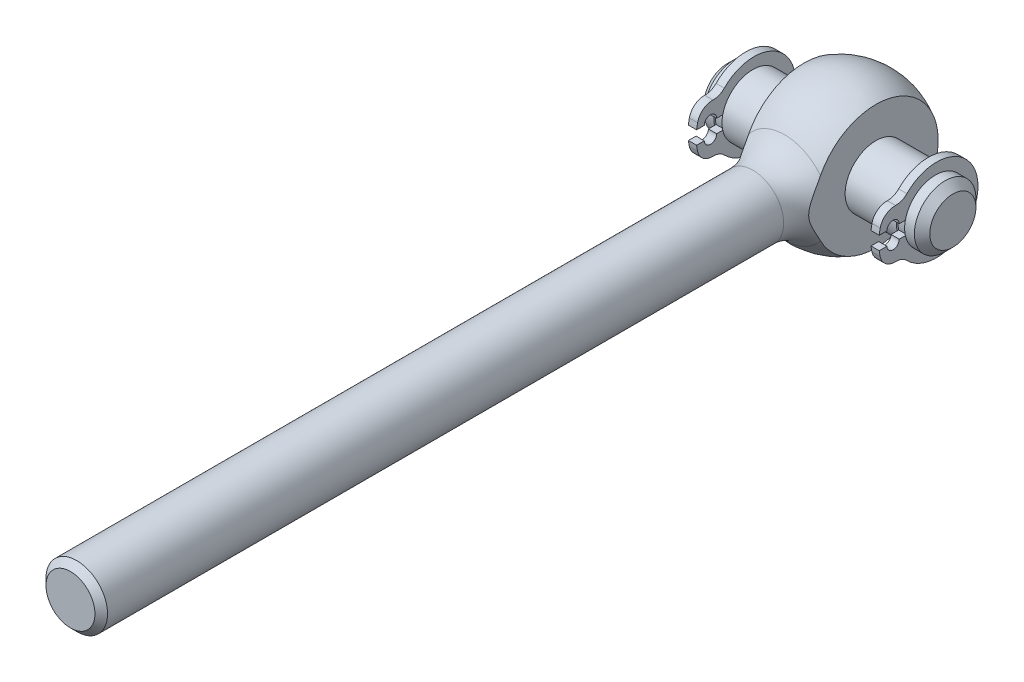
ISO-10303-21;
HEADER;
FILE_DESCRIPTION(('STEP AP214'),'2;1');
FILE_NAME('part.step','',(''),(''),'','','');
FILE_SCHEMA(('AUTOMOTIVE_DESIGN { 1 0 10303 214 1 1 1 1 }'));
ENDSEC;
DATA;
#1=APPLICATION_CONTEXT('core data for automotive mechanical design processes');
#2=APPLICATION_PROTOCOL_DEFINITION('international standard','automotive_design',2000,#1);
#3=PRODUCT_CONTEXT('',#1,'mechanical');
#4=PRODUCT('Part','Part','',(#3));
#5=PRODUCT_RELATED_PRODUCT_CATEGORY('part','',(#4));
#6=PRODUCT_DEFINITION_FORMATION('','',#4);
#7=PRODUCT_DEFINITION_CONTEXT('part definition',#1,'design');
#8=PRODUCT_DEFINITION('design','',#6,#7);
#9=PRODUCT_DEFINITION_SHAPE('','',#8);
#10=(LENGTH_UNIT() NAMED_UNIT(*) SI_UNIT(.MILLI.,.METRE.));
#11=(NAMED_UNIT(*) PLANE_ANGLE_UNIT() SI_UNIT($,.RADIAN.));
#12=(NAMED_UNIT(*) SI_UNIT($,.STERADIAN.) SOLID_ANGLE_UNIT());
#13=UNCERTAINTY_MEASURE_WITH_UNIT(LENGTH_MEASURE(1.E-05),#10,'distance_accuracy_value','');
#14=(GEOMETRIC_REPRESENTATION_CONTEXT(3) GLOBAL_UNCERTAINTY_ASSIGNED_CONTEXT((#13)) GLOBAL_UNIT_ASSIGNED_CONTEXT((#10,
#11,#12)) REPRESENTATION_CONTEXT('',''));
#15=CARTESIAN_POINT('',(0.,0.,0.));
#16=DIRECTION('',(0.,0.,1.));
#17=DIRECTION('',(1.,0.,0.));
#18=AXIS2_PLACEMENT_3D('',#15,#16,#17);
#19=CARTESIAN_POINT('',(0.,2.3865,75.));
#20=DIRECTION('',(0.,0.,1.));
#21=DIRECTION('',(1.,0.,0.));
#22=AXIS2_PLACEMENT_3D('',#19,#20,#21);
#23=PLANE('',#22);
#24=CARTESIAN_POINT('',(0.,0.,75.));
#25=DIRECTION('',(0.,0.,-1.));
#26=DIRECTION('',(-1.,0.,0.));
#27=AXIS2_PLACEMENT_3D('',#24,#25,#26);
#28=CIRCLE('',#27,2.3865);
#29=CARTESIAN_POINT('',(-2.3865,0.,75.));
#30=VERTEX_POINT('',#29);
#31=EDGE_CURVE('E275',#30,#30,#28,.T.);
#32=ORIENTED_EDGE('',*,*,#31,.F.);
#33=EDGE_LOOP('',(#32));
#34=FACE_BOUND('',#33,.T.);
#35=ADVANCED_FACE('F14',(#34),#23,.T.);
#36=CARTESIAN_POINT('',(0.,0.,74.3865));
#37=DIRECTION('',(0.,0.,-1.));
#38=DIRECTION('',(-1.,0.,0.));
#39=AXIS2_PLACEMENT_3D('',#36,#37,#38);
#40=CONICAL_SURFACE('',#39,3.,0.785398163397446);
#41=ORIENTED_EDGE('',*,*,#31,.T.);
#42=EDGE_LOOP('',(#41));
#43=FACE_BOUND('',#42,.T.);
#44=CARTESIAN_POINT('',(0.,0.,74.3865));
#45=DIRECTION('',(0.,0.,-1.));
#46=DIRECTION('',(-1.,0.,0.));
#47=AXIS2_PLACEMENT_3D('',#44,#45,#46);
#48=CIRCLE('',#47,3.);
#49=CARTESIAN_POINT('',(-3.,0.,74.3865));
#50=VERTEX_POINT('',#49);
#51=EDGE_CURVE('E323',#50,#50,#48,.T.);
#52=ORIENTED_EDGE('',*,*,#51,.F.);
#53=EDGE_LOOP('',(#52));
#54=FACE_BOUND('',#53,.T.);
#55=ADVANCED_FACE('F308',(#43,#54),#40,.T.);
#56=CARTESIAN_POINT('',(0.,0.,50.));
#57=DIRECTION('',(0.,0.,-1.));
#58=DIRECTION('',(-1.,0.,0.));
#59=AXIS2_PLACEMENT_3D('',#56,#57,#58);
#60=CYLINDRICAL_SURFACE('',#59,3.);
#61=ORIENTED_EDGE('',*,*,#51,.T.);
#62=EDGE_LOOP('',(#61));
#63=FACE_BOUND('',#62,.T.);
#64=CARTESIAN_POINT('',(0.,0.,8.4852813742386));
#65=DIRECTION('',(0.,0.,-1.));
#66=DIRECTION('',(-1.,0.,0.));
#67=AXIS2_PLACEMENT_3D('',#64,#65,#66);
#68=CIRCLE('',#67,3.);
#69=CARTESIAN_POINT('',(-3.,0.,8.4852813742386));
#70=VERTEX_POINT('',#69);
#71=EDGE_CURVE('E283',#70,#70,#68,.T.);
#72=ORIENTED_EDGE('',*,*,#71,.F.);
#73=EDGE_LOOP('',(#72));
#74=FACE_BOUND('',#73,.T.);
#75=ADVANCED_FACE('F311',(#63,#74),#60,.T.);
#76=CARTESIAN_POINT('',(0.,0.,8.4852813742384));
#77=DIRECTION('',(0.,0.,-1.));
#78=DIRECTION('',(-1.,0.,0.));
#79=AXIS2_PLACEMENT_3D('',#76,#77,#78);
#80=TOROIDAL_SURFACE('',#79,6.99999999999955,3.99999999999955);
#81=CARTESIAN_POINT('',(-3.5,0.,6.54878970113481));
#82=CARTESIAN_POINT('',(-3.5,0.0782367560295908,6.54878476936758));
#83=CARTESIAN_POINT('',(-3.5,0.156486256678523,6.54399338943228));
#84=CARTESIAN_POINT('',(-3.5,0.311904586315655,6.52542851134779));
#85=CARTESIAN_POINT('',(-3.5,0.389072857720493,6.5116505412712));
#86=CARTESIAN_POINT('',(-3.5,0.542864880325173,6.47634059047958));
#87=CARTESIAN_POINT('',(-3.5,0.619460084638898,6.45468788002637));
#88=CARTESIAN_POINT('',(-3.5,0.770686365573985,6.40550595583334));
#89=CARTESIAN_POINT('',(-3.5,0.84531755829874,6.37797709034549));
#90=CARTESIAN_POINT('',(-3.5,0.990475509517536,6.31964070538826));
#91=CARTESIAN_POINT('',(-3.5,1.0610570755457,6.28896711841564));
#92=CARTESIAN_POINT('',(-3.5,1.20095496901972,6.2248424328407));
#93=CARTESIAN_POINT('',(-3.5,1.27027094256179,6.19139057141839));
#94=CARTESIAN_POINT('',(-3.5,1.40805739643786,6.1226067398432));
#95=CARTESIAN_POINT('',(-3.5,1.47652677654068,6.08727258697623));
#96=CARTESIAN_POINT('',(-3.5,1.61287128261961,6.01547151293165));
#97=CARTESIAN_POINT('',(-3.5,1.68074636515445,5.97900450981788));
#98=CARTESIAN_POINT('',(-3.5,1.8843413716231,5.86855007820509));
#99=CARTESIAN_POINT('',(-3.5,2.01960567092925,5.79373111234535));
#100=CARTESIAN_POINT('',(-3.5,2.29073634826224,5.64518750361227));
#101=CARTESIAN_POINT('',(-3.5,2.42660270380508,5.57146282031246));
#102=CARTESIAN_POINT('',(-3.5,2.63115316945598,5.46371576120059));
#103=CARTESIAN_POINT('',(-3.5,2.6991632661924,5.42842140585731));
#104=CARTESIAN_POINT('',(-3.5,2.83572168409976,5.3588883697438));
#105=CARTESIAN_POINT('',(-3.5,2.90427001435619,5.32464970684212));
#106=CARTESIAN_POINT('',(-3.5,3.11088287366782,5.22382755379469));
#107=CARTESIAN_POINT('',(-3.5,3.24989090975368,5.15915092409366));
#108=CARTESIAN_POINT('',(-3.5,3.53052274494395,5.03653931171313));
#109=CARTESIAN_POINT('',(-3.5,3.67214044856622,4.97859047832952));
#110=CARTESIAN_POINT('',(-3.5,3.95835287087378,4.87063721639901));
#111=CARTESIAN_POINT('',(-3.5,4.1029467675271,4.82063062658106));
#112=CARTESIAN_POINT('',(-3.5,4.39174313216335,4.73080083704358));
#113=CARTESIAN_POINT('',(-3.5,4.53588211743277,4.69077501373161));
#114=CARTESIAN_POINT('',(-3.5,4.82657899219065,4.62055692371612));
#115=CARTESIAN_POINT('',(-3.5,4.97313723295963,4.5903660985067));
#116=CARTESIAN_POINT('',(-3.5,5.26901689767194,4.54066539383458));
#117=CARTESIAN_POINT('',(-3.5,5.41834986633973,4.52122344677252));
#118=CARTESIAN_POINT('',(-3.5,5.71808133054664,4.494228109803));
#119=CARTESIAN_POINT('',(-3.5,5.86847964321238,4.48667272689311));
#120=CARTESIAN_POINT('',(-3.5,6.17049107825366,4.48423111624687));
#121=CARTESIAN_POINT('',(-3.5,6.32210510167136,4.4894371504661));
#122=CARTESIAN_POINT('',(-3.5,6.62428545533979,4.51337887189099));
#123=CARTESIAN_POINT('',(-3.5,6.7748517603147,4.53211488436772));
#124=CARTESIAN_POINT('',(-3.5,7.07317925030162,4.58353711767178));
#125=CARTESIAN_POINT('',(-3.5,7.22094695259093,4.6161852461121));
#126=CARTESIAN_POINT('',(-3.5,7.51260902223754,4.69571074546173));
#127=CARTESIAN_POINT('',(-3.5,7.6565038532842,4.74258640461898));
#128=CARTESIAN_POINT('',(-3.5,7.92618294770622,4.84577799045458));
#129=CARTESIAN_POINT('',(-3.5,8.05243498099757,4.90087238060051));
#130=CARTESIAN_POINT('',(-3.5,8.2991578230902,5.02276030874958));
#131=CARTESIAN_POINT('',(-3.5,8.41962935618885,5.08955237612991));
#132=CARTESIAN_POINT('',(-3.5,8.65355594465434,5.23454445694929));
#133=CARTESIAN_POINT('',(-3.5,8.76700903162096,5.31274765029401));
#134=CARTESIAN_POINT('',(-3.5,8.98557819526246,5.48004431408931));
#135=CARTESIAN_POINT('',(-3.5,9.09069538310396,5.56913632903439));
#136=CARTESIAN_POINT('',(-3.5,9.27850709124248,5.74545393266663));
#137=CARTESIAN_POINT('',(-3.5,9.36234970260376,5.83145981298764));
#138=CARTESIAN_POINT('',(-3.5,9.52197024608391,6.01065014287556));
#139=CARTESIAN_POINT('',(-3.5,9.59774910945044,6.10383376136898));
#140=CARTESIAN_POINT('',(-3.5,9.74046949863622,6.29665033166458));
#141=CARTESIAN_POINT('',(-3.5,9.80741657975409,6.39627916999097));
#142=CARTESIAN_POINT('',(-3.5,9.93186490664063,6.60127335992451));
#143=CARTESIAN_POINT('',(-3.5,9.98936654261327,6.70663847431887));
#144=CARTESIAN_POINT('',(-3.5,10.0906075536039,6.91458224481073));
#145=CARTESIAN_POINT('',(-3.5,10.1350345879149,7.01682671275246));
#146=CARTESIAN_POINT('',(-3.5,10.2148555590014,7.2248289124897));
#147=CARTESIAN_POINT('',(-3.5,10.2502462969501,7.33058787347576));
#148=CARTESIAN_POINT('',(-3.5,10.3116354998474,7.54473775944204));
#149=CARTESIAN_POINT('',(-3.5,10.3376388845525,7.65312727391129));
#150=CARTESIAN_POINT('',(-3.5,10.3800495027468,7.8718107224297));
#151=CARTESIAN_POINT('',(-3.5,10.3964532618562,7.98210533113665));
#152=CARTESIAN_POINT('',(-3.5,10.4191020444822,8.19989338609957));
#153=CARTESIAN_POINT('',(-3.5,10.4256771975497,8.30735263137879));
#154=CARTESIAN_POINT('',(-3.5,10.4296706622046,8.52248088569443));
#155=CARTESIAN_POINT('',(-3.5,10.4270856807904,8.63014995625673));
#156=CARTESIAN_POINT('',(-3.5,10.412776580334,8.8448287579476));
#157=CARTESIAN_POINT('',(-3.5,10.4010566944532,8.95183877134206));
#158=CARTESIAN_POINT('',(-3.5,10.3685793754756,9.16451675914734));
#159=CARTESIAN_POINT('',(-3.5,10.3478186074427,9.27018422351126));
#160=CARTESIAN_POINT('',(-3.5,10.2976439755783,9.47850818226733));
#161=CARTESIAN_POINT('',(-3.5,10.2683044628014,9.58118254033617));
#162=CARTESIAN_POINT('',(-3.5,10.201162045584,9.7837373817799));
#163=CARTESIAN_POINT('',(-3.5,10.1633560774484,9.88361683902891));
#164=CARTESIAN_POINT('',(-3.5,10.0376942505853,10.1779511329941));
#165=CARTESIAN_POINT('',(-3.5,9.93754186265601,10.3673185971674));
#166=CARTESIAN_POINT('',(-3.5,9.70610504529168,10.729756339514));
#167=CARTESIAN_POINT('',(-3.5,9.57438239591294,10.9025444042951));
#168=CARTESIAN_POINT('',(-3.5,9.28477122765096,11.2245889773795));
#169=CARTESIAN_POINT('',(-3.5,9.12687900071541,11.3738421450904));
#170=CARTESIAN_POINT('',(-3.5,8.78311734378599,11.6509709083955));
#171=CARTESIAN_POINT('',(-3.5,8.59640032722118,11.7777928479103));
#172=CARTESIAN_POINT('',(-3.5,8.20543541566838,12.000542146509));
#173=CARTESIAN_POINT('',(-3.5,8.00118506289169,12.0964651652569));
#174=CARTESIAN_POINT('',(-3.5,7.56635809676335,12.2620519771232));
#175=CARTESIAN_POINT('',(-3.5,7.33493586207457,12.3294836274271));
#176=CARTESIAN_POINT('',(-3.5,6.86450181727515,12.4286999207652));
#177=CARTESIAN_POINT('',(-3.5,6.62548571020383,12.4604639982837));
#178=CARTESIAN_POINT('',(-3.5,6.25228116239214,12.4836019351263));
#179=CARTESIAN_POINT('',(-3.5,6.11867954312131,12.4866485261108));
#180=CARTESIAN_POINT('',(-3.5,5.85159662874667,12.4828048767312));
#181=CARTESIAN_POINT('',(-3.5,5.71811534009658,12.4759141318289));
#182=CARTESIAN_POINT('',(-3.5,5.45207988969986,12.4527502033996));
#183=CARTESIAN_POINT('',(-3.5,5.31952515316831,12.436483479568));
#184=CARTESIAN_POINT('',(-3.5,5.05577214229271,12.3952072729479));
#185=CARTESIAN_POINT('',(-3.5,4.9245742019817,12.3701956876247));
#186=CARTESIAN_POINT('',(-3.5,4.56970210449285,12.2910884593));
#187=CARTESIAN_POINT('',(-3.5,4.34777651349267,12.2290413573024));
#188=CARTESIAN_POINT('',(-3.5,3.91056368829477,12.0848932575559));
#189=CARTESIAN_POINT('',(-3.5,3.6952805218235,12.0027802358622));
#190=CARTESIAN_POINT('',(-3.5,3.27081294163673,11.8226274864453));
#191=CARTESIAN_POINT('',(-3.5,3.06164921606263,11.7245397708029));
#192=CARTESIAN_POINT('',(-3.5,2.7519490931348,11.569542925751));
#193=CARTESIAN_POINT('',(-3.5,2.64939082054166,11.5165669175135));
#194=CARTESIAN_POINT('',(-3.5,2.44523765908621,11.4087841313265));
#195=CARTESIAN_POINT('',(-3.5,2.34364278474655,11.3539773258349));
#196=CARTESIAN_POINT('',(-3.5,2.13861000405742,11.2421973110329));
#197=CARTESIAN_POINT('',(-3.5,2.03518359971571,11.1852032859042));
#198=CARTESIAN_POINT('',(-3.5,1.82812190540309,11.0715498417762));
#199=CARTESIAN_POINT('',(-3.5,1.72448658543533,11.0148904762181));
#200=CARTESIAN_POINT('',(-3.5,1.51598602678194,10.9036032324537));
#201=CARTESIAN_POINT('',(-3.5,1.41111964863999,10.8489774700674));
#202=CARTESIAN_POINT('',(-3.5,1.19909559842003,10.7443411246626));
#203=CARTESIAN_POINT('',(-3.5,1.09193906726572,10.6943283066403));
#204=CARTESIAN_POINT('',(-3.5,0.921025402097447,10.6224635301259));
#205=CARTESIAN_POINT('',(-3.5,0.858477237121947,10.5977672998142));
#206=CARTESIAN_POINT('',(-3.5,0.732027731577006,10.5520344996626));
#207=CARTESIAN_POINT('',(-3.5,0.668126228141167,10.5309983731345));
#208=CARTESIAN_POINT('',(-3.5,0.539431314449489,10.4937985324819));
#209=CARTESIAN_POINT('',(-3.5,0.474648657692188,10.4775983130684));
#210=CARTESIAN_POINT('',(-3.5,0.343934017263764,10.4509344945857));
#211=CARTESIAN_POINT('',(-3.5,0.278002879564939,10.4404668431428));
#212=CARTESIAN_POINT('',(-3.5,0.144307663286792,10.4259939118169));
#213=CARTESIAN_POINT('',(-3.5,0.0765313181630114,10.4220986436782));
#214=CARTESIAN_POINT('',(-3.5,-0.0590535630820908,10.4214868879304));
#215=CARTESIAN_POINT('',(-3.5,-0.126862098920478,10.4247703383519));
#216=CARTESIAN_POINT('',(-3.5,-0.262256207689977,10.4382439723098));
#217=CARTESIAN_POINT('',(-3.5,-0.329836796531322,10.448482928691));
#218=CARTESIAN_POINT('',(-3.5,-0.463736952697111,10.4750202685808));
#219=CARTESIAN_POINT('',(-3.5,-0.530057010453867,10.491316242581));
#220=CARTESIAN_POINT('',(-3.5,-0.724375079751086,10.5468482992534));
#221=CARTESIAN_POINT('',(-3.5,-0.850344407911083,10.5930733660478));
#222=CARTESIAN_POINT('',(-3.5,-1.09778317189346,10.6964772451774));
#223=CARTESIAN_POINT('',(-3.5,-1.21923957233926,10.7536852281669));
#224=CARTESIAN_POINT('',(-3.5,-1.46028171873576,10.8740385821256));
#225=CARTESIAN_POINT('',(-3.5,-1.57984611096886,10.9372259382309));
#226=CARTESIAN_POINT('',(-3.5,-1.8177028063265,11.0655869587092));
#227=CARTESIAN_POINT('',(-3.5,-1.93599638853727,11.1307583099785));
#228=CARTESIAN_POINT('',(-3.5,-2.17412740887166,11.2615841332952));
#229=CARTESIAN_POINT('',(-3.5,-2.29396670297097,11.3272353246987));
#230=CARTESIAN_POINT('',(-3.5,-2.53478060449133,11.4565191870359));
#231=CARTESIAN_POINT('',(-3.5,-2.65575550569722,11.5201513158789));
#232=CARTESIAN_POINT('',(-3.5,-2.89895928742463,11.6437520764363));
#233=CARTESIAN_POINT('',(-3.5,-3.02118107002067,11.7037345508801));
#234=CARTESIAN_POINT('',(-3.5,-3.26773701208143,11.8191610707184));
#235=CARTESIAN_POINT('',(-3.5,-3.39207085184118,11.8746057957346));
#236=CARTESIAN_POINT('',(-3.5,-3.67876386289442,11.9949236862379));
#237=CARTESIAN_POINT('',(-3.5,-3.84188810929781,12.0579986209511));
#238=CARTESIAN_POINT('',(-3.5,-4.17218485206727,12.1730997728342));
#239=CARTESIAN_POINT('',(-3.5,-4.339360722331,12.2251164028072));
#240=CARTESIAN_POINT('',(-3.5,-4.67721259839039,12.316242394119));
#241=CARTESIAN_POINT('',(-3.5,-4.84788825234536,12.3553530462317));
#242=CARTESIAN_POINT('',(-3.5,-5.19198514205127,12.4190378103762));
#243=CARTESIAN_POINT('',(-3.5,-5.3654064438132,12.443611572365));
#244=CARTESIAN_POINT('',(-3.5,-5.68047487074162,12.4735918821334));
#245=CARTESIAN_POINT('',(-3.5,-5.82186037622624,12.481763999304));
#246=CARTESIAN_POINT('',(-3.5,-6.10482824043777,12.4869745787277));
#247=CARTESIAN_POINT('',(-3.5,-6.24641055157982,12.4840153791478));
#248=CARTESIAN_POINT('',(-3.5,-6.52869568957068,12.4664147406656));
#249=CARTESIAN_POINT('',(-3.5,-6.6693993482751,12.4517869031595));
#250=CARTESIAN_POINT('',(-3.5,-6.94896407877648,12.4104451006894));
#251=CARTESIAN_POINT('',(-3.5,-7.08782602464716,12.3837370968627));
#252=CARTESIAN_POINT('',(-3.5,-7.36371184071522,12.3176877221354));
#253=CARTESIAN_POINT('',(-3.5,-7.50071188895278,12.2782463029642));
#254=CARTESIAN_POINT('',(-3.5,-7.77035284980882,12.1866985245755));
#255=CARTESIAN_POINT('',(-3.5,-7.90299588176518,12.134598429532));
#256=CARTESIAN_POINT('',(-3.5,-8.16270649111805,12.0177581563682));
#257=CARTESIAN_POINT('',(-3.5,-8.28977050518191,11.9530100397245));
#258=CARTESIAN_POINT('',(-3.5,-8.53681055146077,11.8111723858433));
#259=CARTESIAN_POINT('',(-3.5,-8.65678766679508,11.7340847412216));
#260=CARTESIAN_POINT('',(-3.5,-8.87380037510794,11.5784201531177));
#261=CARTESIAN_POINT('',(-3.5,-8.97183121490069,11.5012273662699));
#262=CARTESIAN_POINT('',(-3.5,-9.16044585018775,11.3382301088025));
#263=CARTESIAN_POINT('',(-3.5,-9.25103056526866,11.2524267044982));
#264=CARTESIAN_POINT('',(-3.5,-9.42379734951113,11.0728552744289));
#265=CARTESIAN_POINT('',(-3.5,-9.50598539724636,10.9790930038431));
#266=CARTESIAN_POINT('',(-3.5,-9.66118589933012,10.784257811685));
#267=CARTESIAN_POINT('',(-3.5,-9.73419894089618,10.6831853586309));
#268=CARTESIAN_POINT('',(-3.5,-9.86432760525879,10.483675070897));
#269=CARTESIAN_POINT('',(-3.5,-9.92227484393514,10.3857786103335));
#270=CARTESIAN_POINT('',(-3.5,-10.0293819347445,10.1852434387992));
#271=CARTESIAN_POINT('',(-3.5,-10.0785388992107,10.0826031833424));
#272=CARTESIAN_POINT('',(-3.5,-10.1675597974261,9.87343685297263));
#273=CARTESIAN_POINT('',(-3.5,-10.2074289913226,9.76691301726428));
#274=CARTESIAN_POINT('',(-3.5,-10.2775497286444,9.55069977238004));
#275=CARTESIAN_POINT('',(-3.5,-10.3077978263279,9.44100924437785));
#276=CARTESIAN_POINT('',(-3.5,-10.3572212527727,9.22439625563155));
#277=CARTESIAN_POINT('',(-3.5,-10.3768366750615,9.11757398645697));
#278=CARTESIAN_POINT('',(-3.5,-10.4068585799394,8.90260210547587));
#279=CARTESIAN_POINT('',(-3.5,-10.4172617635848,8.79445203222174));
#280=CARTESIAN_POINT('',(-3.5,-10.428751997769,8.57771306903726));
#281=CARTESIAN_POINT('',(-3.5,-10.4298437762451,8.46912442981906));
#282=CARTESIAN_POINT('',(-3.5,-10.4227139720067,8.25221481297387));
#283=CARTESIAN_POINT('',(-3.5,-10.4144889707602,8.14389394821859));
#284=CARTESIAN_POINT('',(-3.5,-10.3890046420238,7.93016658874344));
#285=CARTESIAN_POINT('',(-3.5,-10.3718999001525,7.82474174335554));
#286=CARTESIAN_POINT('',(-3.5,-10.328902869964,7.61568844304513));
#287=CARTESIAN_POINT('',(-3.5,-10.3030074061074,7.51206065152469));
#288=CARTESIAN_POINT('',(-3.5,-10.2124351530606,7.20505334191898));
#289=CARTESIAN_POINT('',(-3.5,-10.1348449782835,7.00532194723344));
#290=CARTESIAN_POINT('',(-3.5,-9.94721357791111,6.62018174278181));
#291=CARTESIAN_POINT('',(-3.5,-9.83695218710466,6.43488123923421));
#292=CARTESIAN_POINT('',(-3.5,-9.58772884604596,6.0847183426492));
#293=CARTESIAN_POINT('',(-3.5,-9.44876542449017,5.91985699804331));
#294=CARTESIAN_POINT('',(-3.5,-9.14187609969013,5.60978056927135));
#295=CARTESIAN_POINT('',(-3.5,-8.9732067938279,5.46530266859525));
#296=CARTESIAN_POINT('',(-3.5,-8.61510303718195,5.20493268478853));
#297=CARTESIAN_POINT('',(-3.5,-8.42566225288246,5.08904935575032));
#298=CARTESIAN_POINT('',(-3.5,-8.02009969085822,4.88180585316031));
#299=CARTESIAN_POINT('',(-3.5,-7.80307226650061,4.792222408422));
#300=CARTESIAN_POINT('',(-3.5,-7.35800132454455,4.64739430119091));
#301=CARTESIAN_POINT('',(-3.5,-7.12995869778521,4.5921468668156));
#302=CARTESIAN_POINT('',(-3.5,-6.64682271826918,4.51147517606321));
#303=CARTESIAN_POINT('',(-3.5,-6.39119058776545,4.48931426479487));
#304=CARTESIAN_POINT('',(-3.5,-5.8792525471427,4.48225191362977));
#305=CARTESIAN_POINT('',(-3.5,-5.62294619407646,4.49739724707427));
#306=CARTESIAN_POINT('',(-3.5,-5.17570694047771,4.55335787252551));
#307=CARTESIAN_POINT('',(-3.5,-4.98383400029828,4.58714781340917));
#308=CARTESIAN_POINT('',(-3.5,-4.60383202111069,4.6718753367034));
#309=CARTESIAN_POINT('',(-3.5,-4.41570510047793,4.72282234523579));
#310=CARTESIAN_POINT('',(-3.5,-4.04400052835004,4.83954828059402));
#311=CARTESIAN_POINT('',(-3.5,-3.86042700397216,4.90534015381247));
#312=CARTESIAN_POINT('',(-3.5,-3.49828577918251,5.04909437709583));
#313=CARTESIAN_POINT('',(-3.5,-3.3197152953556,5.12704979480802));
#314=CARTESIAN_POINT('',(-3.5,-3.04255659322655,5.25683150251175));
#315=CARTESIAN_POINT('',(-3.5,-2.94248104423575,5.30554203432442));
#316=CARTESIAN_POINT('',(-3.5,-2.74353516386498,5.40536875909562));
#317=CARTESIAN_POINT('',(-3.5,-2.64466485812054,5.45648500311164));
#318=CARTESIAN_POINT('',(-3.5,-2.44763340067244,5.56051973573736));
#319=CARTESIAN_POINT('',(-3.5,-2.34947404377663,5.6134415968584));
#320=CARTESIAN_POINT('',(-3.5,-2.15363735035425,5.72014082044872));
#321=CARTESIAN_POINT('',(-3.5,-2.05595996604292,5.77391809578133));
#322=CARTESIAN_POINT('',(-3.5,-1.86081978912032,5.88109395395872));
#323=CARTESIAN_POINT('',(-3.5,-1.76335736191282,5.93449320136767));
#324=CARTESIAN_POINT('',(-3.5,-1.56751643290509,6.0397232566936));
#325=CARTESIAN_POINT('',(-3.5,-1.46913751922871,6.09155331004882));
#326=CARTESIAN_POINT('',(-3.5,-1.27091584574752,6.19147743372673));
#327=CARTESIAN_POINT('',(-3.5,-1.17107955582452,6.23958416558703));
#328=CARTESIAN_POINT('',(-3.5,-0.968601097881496,6.32941097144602));
#329=CARTESIAN_POINT('',(-3.5,-0.86596230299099,6.3711383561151));
#330=CARTESIAN_POINT('',(-3.5,-0.699946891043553,6.42919438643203));
#331=CARTESIAN_POINT('',(-3.5,-0.637769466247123,6.44891365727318));
#332=CARTESIAN_POINT('',(-3.5,-0.512100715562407,6.48375370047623));
#333=CARTESIAN_POINT('',(-3.5,-0.44860913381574,6.49887356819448));
#334=CARTESIAN_POINT('',(-3.5,-0.321228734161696,6.52338736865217));
#335=CARTESIAN_POINT('',(-3.5,-0.257351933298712,6.53284235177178));
#336=CARTESIAN_POINT('',(-3.5,-0.12898621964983,6.5455448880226));
#337=CARTESIAN_POINT('',(-3.5,-0.0644974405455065,6.54879376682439));
#338=CARTESIAN_POINT('',(-3.5,0.,6.54878970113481));
#339=B_SPLINE_CURVE_WITH_KNOTS('',3,(#81,#82,#83,#84,#85,#86,#87,#88,#89,#90,#91,#92,#93,#94,
#95,#96,#97,#98,#99,#100,#101,#102,#103,#104,#105,#106,#107,#108,#109,#110,#111,#112,#113,#114,
#115,#116,#117,#118,#119,#120,#121,#122,#123,#124,#125,#126,#127,#128,#129,#130,#131,#132,#133,
#134,#135,#136,#137,#138,#139,#140,#141,#142,#143,#144,#145,#146,#147,#148,#149,#150,#151,#152,
#153,#154,#155,#156,#157,#158,#159,#160,#161,#162,#163,#164,#165,#166,#167,#168,#169,#170,#171,
#172,#173,#174,#175,#176,#177,#178,#179,#180,#181,#182,#183,#184,#185,#186,#187,#188,#189,#190,
#191,#192,#193,#194,#195,#196,#197,#198,#199,#200,#201,#202,#203,#204,#205,#206,#207,#208,#209,
#210,#211,#212,#213,#214,#215,#216,#217,#218,#219,#220,#221,#222,#223,#224,#225,#226,#227,#228,
#229,#230,#231,#232,#233,#234,#235,#236,#237,#238,#239,#240,#241,#242,#243,#244,#245,#246,#247,
#248,#249,#250,#251,#252,#253,#254,#255,#256,#257,#258,#259,#260,#261,#262,#263,#264,#265,#266,
#267,#268,#269,#270,#271,#272,#273,#274,#275,#276,#277,#278,#279,#280,#281,#282,#283,#284,#285,
#286,#287,#288,#289,#290,#291,#292,#293,#294,#295,#296,#297,#298,#299,#300,#301,#302,#303,#304,
#305,#306,#307,#308,#309,#310,#311,#312,#313,#314,#315,#316,#317,#318,#319,#320,#321,#322,#323,
#324,#325,#326,#327,#328,#329,#330,#331,#332,#333,#334,#335,#336,#337,#338),.UNSPECIFIED.,.T.,
.F.,(4,2,2,2,2,2,2,2,2,2,2,2,2,2,2,2,2,2,2,2,2,2,2,2,2,2,2,2,2,2,2,2,2,2,2,2,2,2,2,2,2,2,2,2,2,
2,2,2,2,2,2,2,2,2,2,2,2,2,2,2,2,2,2,2,2,2,2,2,2,2,2,2,2,2,2,2,2,2,2,2,2,2,2,2,2,2,2,2,2,2,2,2,2,
2,2,2,2,2,2,2,2,2,2,2,2,2,2,2,2,2,2,2,2,2,2,2,2,2,2,2,2,2,2,2,2,2,2,2,4),(0.,0.234598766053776,
0.4693143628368,0.707791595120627,0.94625469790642,1.17704793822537,1.40790475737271,
1.6390353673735,1.87018273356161,2.33391650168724,2.7976330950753,3.02749280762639,
3.25735640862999,3.71716644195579,4.17601240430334,4.63473328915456,5.0832015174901,
5.53173544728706,5.98307259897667,6.43433406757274,6.88886765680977,7.34341217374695,
7.79672003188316,8.24997337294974,8.66263139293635,9.07523757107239,9.48795894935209,
9.90062521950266,10.2604913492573,10.6203158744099,10.9799129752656,11.3394952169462,
11.6735211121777,12.0076650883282,12.3416336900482,12.675723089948,12.9983168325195,
13.3210265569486,13.6435868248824,13.9662661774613,14.2862278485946,14.6063054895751,
15.2458000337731,15.894745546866,16.5437830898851,17.2179937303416,17.8922990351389,
18.6125080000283,19.3331320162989,19.7337209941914,20.1343303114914,20.5346639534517,
20.9350939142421,21.625149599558,22.3156197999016,23.0082037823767,23.3544898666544,
23.7007811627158,24.0550552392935,24.4093844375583,24.7640725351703,25.1185878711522,
25.3202448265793,25.5219261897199,25.7220441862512,25.9220205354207,26.1253121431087,
26.3286019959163,26.5333322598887,26.7379811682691,27.1394631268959,27.5420265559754,
27.9476626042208,28.3528425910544,28.7627677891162,29.1728021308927,29.5811694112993,
29.9894754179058,30.513813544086,31.0386044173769,31.5633427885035,32.0880937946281,
32.5125579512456,32.9369329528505,33.3608140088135,33.7844861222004,34.2115715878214,
34.6384461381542,35.065589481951,35.4926673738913,35.8664943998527,36.2402751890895,
36.6137879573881,36.9872768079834,37.3281333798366,37.6691017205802,38.009876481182,
38.3507731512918,38.6762039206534,39.0017511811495,39.3271331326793,39.652634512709,
39.9726504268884,40.2927820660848,40.932365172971,41.5763603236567,42.2203884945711,
42.8837248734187,43.5472640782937,44.2486672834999,44.9500138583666,45.7167946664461,
46.4845373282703,47.0682038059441,47.6521914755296,48.2366904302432,48.8208574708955,
49.154730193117,49.4886100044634,49.8231518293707,50.1576597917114,50.4910562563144,
50.8246105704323,51.1569756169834,51.4889568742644,51.6845078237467,51.880097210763,
52.073538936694,52.2669393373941),.UNSPECIFIED.);
#340=CARTESIAN_POINT('',(-3.5,-2.75553537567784,5.3997245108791));
#341=VERTEX_POINT('',#340);
#342=CARTESIAN_POINT('',(-3.5,2.75553537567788,5.39972451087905));
#343=VERTEX_POINT('',#342);
#344=EDGE_CURVE('E9',#341,#343,#339,.T.);
#345=ORIENTED_EDGE('',*,*,#344,.F.);
#346=CARTESIAN_POINT('',(0.,0.,5.3997245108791));
#347=DIRECTION('',(0.,0.,-1.));
#348=DIRECTION('',(-1.,0.,0.));
#349=AXIS2_PLACEMENT_3D('',#346,#347,#348);
#350=CIRCLE('',#349,4.4545454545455);
#351=CARTESIAN_POINT('',(3.5,-2.75553537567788,5.39972451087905));
#352=VERTEX_POINT('',#351);
#353=EDGE_CURVE('E270',#352,#341,#350,.T.);
#354=ORIENTED_EDGE('',*,*,#353,.F.);
#355=CARTESIAN_POINT('',(3.5,0.,6.54878970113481));
#356=CARTESIAN_POINT('',(3.5,-0.0782367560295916,6.54878476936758));
#357=CARTESIAN_POINT('',(3.5,-0.156486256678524,6.54399338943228));
#358=CARTESIAN_POINT('',(3.5,-0.311904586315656,6.52542851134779));
#359=CARTESIAN_POINT('',(3.5,-0.389072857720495,6.5116505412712));
#360=CARTESIAN_POINT('',(3.5,-0.542864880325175,6.47634059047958));
#361=CARTESIAN_POINT('',(3.5,-0.619460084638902,6.45468788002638));
#362=CARTESIAN_POINT('',(3.5,-0.770686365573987,6.40550595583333));
#363=CARTESIAN_POINT('',(3.5,-0.845317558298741,6.37797709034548));
#364=CARTESIAN_POINT('',(3.5,-0.990475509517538,6.31964070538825));
#365=CARTESIAN_POINT('',(3.5,-1.06105707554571,6.28896711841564));
#366=CARTESIAN_POINT('',(3.5,-1.20095496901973,6.2248424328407));
#367=CARTESIAN_POINT('',(3.5,-1.27027094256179,6.19139057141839));
#368=CARTESIAN_POINT('',(3.5,-1.40805739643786,6.1226067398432));
#369=CARTESIAN_POINT('',(3.5,-1.47652677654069,6.08727258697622));
#370=CARTESIAN_POINT('',(3.5,-1.61287128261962,6.01547151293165));
#371=CARTESIAN_POINT('',(3.5,-1.68074636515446,5.97900450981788));
#372=CARTESIAN_POINT('',(3.5,-1.88434137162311,5.86855007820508));
#373=CARTESIAN_POINT('',(3.5,-2.01960567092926,5.79373111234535));
#374=CARTESIAN_POINT('',(3.5,-2.29073634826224,5.64518750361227));
#375=CARTESIAN_POINT('',(3.5,-2.42660270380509,5.57146282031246));
#376=CARTESIAN_POINT('',(3.5,-2.63115316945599,5.46371576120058));
#377=CARTESIAN_POINT('',(3.5,-2.69916326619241,5.42842140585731));
#378=CARTESIAN_POINT('',(3.5,-2.83572168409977,5.35888836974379));
#379=CARTESIAN_POINT('',(3.5,-2.9042700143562,5.32464970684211));
#380=CARTESIAN_POINT('',(3.5,-3.11088287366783,5.22382755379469));
#381=CARTESIAN_POINT('',(3.5,-3.24989090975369,5.15915092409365));
#382=CARTESIAN_POINT('',(3.5,-3.53052274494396,5.03653931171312));
#383=CARTESIAN_POINT('',(3.5,-3.67214044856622,4.97859047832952));
#384=CARTESIAN_POINT('',(3.5,-3.95835287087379,4.87063721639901));
#385=CARTESIAN_POINT('',(3.5,-4.1029467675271,4.82063062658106));
#386=CARTESIAN_POINT('',(3.5,-4.39174313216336,4.73080083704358));
#387=CARTESIAN_POINT('',(3.5,-4.53588211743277,4.69077501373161));
#388=CARTESIAN_POINT('',(3.5,-4.82657899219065,4.62055692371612));
#389=CARTESIAN_POINT('',(3.5,-4.97313723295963,4.5903660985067));
#390=CARTESIAN_POINT('',(3.5,-5.26901689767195,4.54066539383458));
#391=CARTESIAN_POINT('',(3.5,-5.41834986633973,4.52122344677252));
#392=CARTESIAN_POINT('',(3.5,-5.71808133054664,4.494228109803));
#393=CARTESIAN_POINT('',(3.5,-5.86847964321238,4.48667272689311));
#394=CARTESIAN_POINT('',(3.5,-6.17049107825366,4.48423111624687));
#395=CARTESIAN_POINT('',(3.5,-6.32210510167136,4.4894371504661));
#396=CARTESIAN_POINT('',(3.5,-6.62428545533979,4.51337887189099));
#397=CARTESIAN_POINT('',(3.5,-6.7748517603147,4.53211488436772));
#398=CARTESIAN_POINT('',(3.5,-7.07317925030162,4.58353711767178));
#399=CARTESIAN_POINT('',(3.5,-7.22094695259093,4.6161852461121));
#400=CARTESIAN_POINT('',(3.5,-7.51260902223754,4.69571074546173));
#401=CARTESIAN_POINT('',(3.5,-7.6565038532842,4.74258640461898));
#402=CARTESIAN_POINT('',(3.5,-7.92618294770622,4.84577799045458));
#403=CARTESIAN_POINT('',(3.5,-8.05243498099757,4.90087238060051));
#404=CARTESIAN_POINT('',(3.5,-8.2991578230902,5.02276030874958));
#405=CARTESIAN_POINT('',(3.5,-8.41962935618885,5.08955237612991));
#406=CARTESIAN_POINT('',(3.5,-8.65355594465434,5.23454445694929));
#407=CARTESIAN_POINT('',(3.5,-8.76700903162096,5.31274765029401));
#408=CARTESIAN_POINT('',(3.5,-8.98557819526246,5.48004431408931));
#409=CARTESIAN_POINT('',(3.5,-9.09069538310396,5.56913632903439));
#410=CARTESIAN_POINT('',(3.5,-9.27850709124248,5.74545393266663));
#411=CARTESIAN_POINT('',(3.5,-9.36234970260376,5.83145981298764));
#412=CARTESIAN_POINT('',(3.5,-9.52197024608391,6.01065014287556));
#413=CARTESIAN_POINT('',(3.5,-9.59774910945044,6.10383376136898));
#414=CARTESIAN_POINT('',(3.5,-9.74046949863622,6.29665033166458));
#415=CARTESIAN_POINT('',(3.5,-9.80741657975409,6.39627916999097));
#416=CARTESIAN_POINT('',(3.5,-9.93186490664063,6.60127335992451));
#417=CARTESIAN_POINT('',(3.5,-9.98936654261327,6.70663847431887));
#418=CARTESIAN_POINT('',(3.5,-10.0906075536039,6.91458224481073));
#419=CARTESIAN_POINT('',(3.5,-10.1350345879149,7.01682671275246));
#420=CARTESIAN_POINT('',(3.5,-10.2148555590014,7.2248289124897));
#421=CARTESIAN_POINT('',(3.5,-10.2502462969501,7.33058787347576));
#422=CARTESIAN_POINT('',(3.5,-10.3116354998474,7.54473775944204));
#423=CARTESIAN_POINT('',(3.5,-10.3376388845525,7.65312727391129));
#424=CARTESIAN_POINT('',(3.5,-10.3800495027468,7.8718107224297));
#425=CARTESIAN_POINT('',(3.5,-10.3964532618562,7.98210533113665));
#426=CARTESIAN_POINT('',(3.5,-10.4191020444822,8.19989338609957));
#427=CARTESIAN_POINT('',(3.5,-10.4256771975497,8.30735263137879));
#428=CARTESIAN_POINT('',(3.5,-10.4296706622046,8.52248088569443));
#429=CARTESIAN_POINT('',(3.5,-10.4270856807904,8.63014995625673));
#430=CARTESIAN_POINT('',(3.5,-10.412776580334,8.8448287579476));
#431=CARTESIAN_POINT('',(3.5,-10.4010566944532,8.95183877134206));
#432=CARTESIAN_POINT('',(3.5,-10.3685793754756,9.16451675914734));
#433=CARTESIAN_POINT('',(3.5,-10.3478186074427,9.27018422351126));
#434=CARTESIAN_POINT('',(3.5,-10.2976439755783,9.47850818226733));
#435=CARTESIAN_POINT('',(3.5,-10.2683044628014,9.58118254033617));
#436=CARTESIAN_POINT('',(3.5,-10.201162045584,9.7837373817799));
#437=CARTESIAN_POINT('',(3.5,-10.1633560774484,9.88361683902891));
#438=CARTESIAN_POINT('',(3.5,-10.0376942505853,10.1779511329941));
#439=CARTESIAN_POINT('',(3.5,-9.93754186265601,10.3673185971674));
#440=CARTESIAN_POINT('',(3.5,-9.70610504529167,10.729756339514));
#441=CARTESIAN_POINT('',(3.5,-9.57438239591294,10.9025444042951));
#442=CARTESIAN_POINT('',(3.5,-9.28477122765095,11.2245889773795));
#443=CARTESIAN_POINT('',(3.5,-9.12687900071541,11.3738421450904));
#444=CARTESIAN_POINT('',(3.5,-8.78311734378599,11.6509709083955));
#445=CARTESIAN_POINT('',(3.5,-8.59640032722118,11.7777928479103));
#446=CARTESIAN_POINT('',(3.5,-8.20543541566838,12.000542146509));
#447=CARTESIAN_POINT('',(3.5,-8.00118506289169,12.0964651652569));
#448=CARTESIAN_POINT('',(3.5,-7.56635809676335,12.2620519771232));
#449=CARTESIAN_POINT('',(3.5,-7.33493586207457,12.3294836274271));
#450=CARTESIAN_POINT('',(3.5,-6.86450181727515,12.4286999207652));
#451=CARTESIAN_POINT('',(3.5,-6.62548571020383,12.4604639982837));
#452=CARTESIAN_POINT('',(3.5,-6.25228116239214,12.4836019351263));
#453=CARTESIAN_POINT('',(3.5,-6.11867954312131,12.4866485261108));
#454=CARTESIAN_POINT('',(3.5,-5.85159662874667,12.4828048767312));
#455=CARTESIAN_POINT('',(3.5,-5.71811534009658,12.4759141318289));
#456=CARTESIAN_POINT('',(3.5,-5.45207988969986,12.4527502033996));
#457=CARTESIAN_POINT('',(3.5,-5.31952515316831,12.436483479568));
#458=CARTESIAN_POINT('',(3.5,-5.05577214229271,12.3952072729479));
#459=CARTESIAN_POINT('',(3.5,-4.9245742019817,12.3701956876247));
#460=CARTESIAN_POINT('',(3.5,-4.56970210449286,12.2910884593));
#461=CARTESIAN_POINT('',(3.5,-4.34777651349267,12.2290413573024));
#462=CARTESIAN_POINT('',(3.5,-3.91056368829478,12.084893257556));
#463=CARTESIAN_POINT('',(3.5,-3.69528052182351,12.0027802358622));
#464=CARTESIAN_POINT('',(3.5,-3.27081294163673,11.8226274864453));
#465=CARTESIAN_POINT('',(3.5,-3.06164921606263,11.7245397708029));
#466=CARTESIAN_POINT('',(3.5,-2.7519490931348,11.569542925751));
#467=CARTESIAN_POINT('',(3.5,-2.64939082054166,11.5165669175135));
#468=CARTESIAN_POINT('',(3.5,-2.44523765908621,11.4087841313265));
#469=CARTESIAN_POINT('',(3.5,-2.34364278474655,11.3539773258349));
#470=CARTESIAN_POINT('',(3.5,-2.13861000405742,11.2421973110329));
#471=CARTESIAN_POINT('',(3.5,-2.03518359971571,11.1852032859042));
#472=CARTESIAN_POINT('',(3.5,-1.82812190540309,11.0715498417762));
#473=CARTESIAN_POINT('',(3.5,-1.72448658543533,11.0148904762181));
#474=CARTESIAN_POINT('',(3.5,-1.51598602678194,10.9036032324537));
#475=CARTESIAN_POINT('',(3.5,-1.41111964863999,10.8489774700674));
#476=CARTESIAN_POINT('',(3.5,-1.19909559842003,10.7443411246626));
#477=CARTESIAN_POINT('',(3.5,-1.09193906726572,10.6943283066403));
#478=CARTESIAN_POINT('',(3.5,-0.921025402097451,10.6224635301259));
#479=CARTESIAN_POINT('',(3.5,-0.858477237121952,10.5977672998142));
#480=CARTESIAN_POINT('',(3.5,-0.732027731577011,10.5520344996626));
#481=CARTESIAN_POINT('',(3.5,-0.668126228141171,10.5309983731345));
#482=CARTESIAN_POINT('',(3.5,-0.539431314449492,10.4937985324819));
#483=CARTESIAN_POINT('',(3.5,-0.474648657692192,10.4775983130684));
#484=CARTESIAN_POINT('',(3.5,-0.343934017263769,10.4509344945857));
#485=CARTESIAN_POINT('',(3.5,-0.278002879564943,10.4404668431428));
#486=CARTESIAN_POINT('',(3.5,-0.144307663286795,10.4259939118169));
#487=CARTESIAN_POINT('',(3.5,-0.0765313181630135,10.4220986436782));
#488=CARTESIAN_POINT('',(3.5,0.059053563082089,10.4214868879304));
#489=CARTESIAN_POINT('',(3.5,0.126862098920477,10.4247703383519));
#490=CARTESIAN_POINT('',(3.5,0.262256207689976,10.4382439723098));
#491=CARTESIAN_POINT('',(3.5,0.329836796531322,10.448482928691));
#492=CARTESIAN_POINT('',(3.5,0.463736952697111,10.4750202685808));
#493=CARTESIAN_POINT('',(3.5,0.530057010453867,10.491316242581));
#494=CARTESIAN_POINT('',(3.5,0.724375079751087,10.5468482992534));
#495=CARTESIAN_POINT('',(3.5,0.850344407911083,10.5930733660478));
#496=CARTESIAN_POINT('',(3.5,1.09778317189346,10.6964772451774));
#497=CARTESIAN_POINT('',(3.5,1.21923957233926,10.7536852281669));
#498=CARTESIAN_POINT('',(3.5,1.46028171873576,10.8740385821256));
#499=CARTESIAN_POINT('',(3.5,1.57984611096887,10.9372259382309));
#500=CARTESIAN_POINT('',(3.5,1.81770280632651,11.0655869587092));
#501=CARTESIAN_POINT('',(3.5,1.93599638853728,11.1307583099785));
#502=CARTESIAN_POINT('',(3.5,2.17412740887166,11.2615841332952));
#503=CARTESIAN_POINT('',(3.5,2.29396670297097,11.3272353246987));
#504=CARTESIAN_POINT('',(3.5,2.53478060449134,11.4565191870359));
#505=CARTESIAN_POINT('',(3.5,2.65575550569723,11.5201513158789));
#506=CARTESIAN_POINT('',(3.5,2.89895928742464,11.6437520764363));
#507=CARTESIAN_POINT('',(3.5,3.02118107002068,11.7037345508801));
#508=CARTESIAN_POINT('',(3.5,3.26773701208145,11.8191610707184));
#509=CARTESIAN_POINT('',(3.5,3.39207085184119,11.8746057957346));
#510=CARTESIAN_POINT('',(3.5,3.67876386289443,11.9949236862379));
#511=CARTESIAN_POINT('',(3.5,3.84188810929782,12.0579986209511));
#512=CARTESIAN_POINT('',(3.5,4.17218485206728,12.1730997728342));
#513=CARTESIAN_POINT('',(3.5,4.339360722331,12.2251164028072));
#514=CARTESIAN_POINT('',(3.5,4.67721259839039,12.316242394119));
#515=CARTESIAN_POINT('',(3.5,4.84788825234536,12.3553530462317));
#516=CARTESIAN_POINT('',(3.5,5.19198514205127,12.4190378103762));
#517=CARTESIAN_POINT('',(3.5,5.3654064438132,12.443611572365));
#518=CARTESIAN_POINT('',(3.5,5.68047487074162,12.4735918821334));
#519=CARTESIAN_POINT('',(3.5,5.82186037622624,12.481763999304));
#520=CARTESIAN_POINT('',(3.5,6.10482824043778,12.4869745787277));
#521=CARTESIAN_POINT('',(3.5,6.24641055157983,12.4840153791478));
#522=CARTESIAN_POINT('',(3.5,6.52869568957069,12.4664147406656));
#523=CARTESIAN_POINT('',(3.5,6.66939934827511,12.4517869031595));
#524=CARTESIAN_POINT('',(3.5,6.94896407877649,12.4104451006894));
#525=CARTESIAN_POINT('',(3.5,7.08782602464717,12.3837370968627));
#526=CARTESIAN_POINT('',(3.5,7.36371184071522,12.3176877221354));
#527=CARTESIAN_POINT('',(3.5,7.50071188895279,12.2782463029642));
#528=CARTESIAN_POINT('',(3.5,7.77035284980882,12.1866985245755));
#529=CARTESIAN_POINT('',(3.5,7.90299588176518,12.134598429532));
#530=CARTESIAN_POINT('',(3.5,8.16270649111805,12.0177581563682));
#531=CARTESIAN_POINT('',(3.5,8.28977050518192,11.9530100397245));
#532=CARTESIAN_POINT('',(3.5,8.53681055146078,11.8111723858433));
#533=CARTESIAN_POINT('',(3.5,8.65678766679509,11.7340847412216));
#534=CARTESIAN_POINT('',(3.5,8.87380037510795,11.5784201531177));
#535=CARTESIAN_POINT('',(3.5,8.9718312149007,11.5012273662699));
#536=CARTESIAN_POINT('',(3.5,9.16044585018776,11.3382301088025));
#537=CARTESIAN_POINT('',(3.5,9.25103056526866,11.2524267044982));
#538=CARTESIAN_POINT('',(3.5,9.42379734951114,11.0728552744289));
#539=CARTESIAN_POINT('',(3.5,9.50598539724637,10.9790930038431));
#540=CARTESIAN_POINT('',(3.5,9.66118589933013,10.784257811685));
#541=CARTESIAN_POINT('',(3.5,9.73419894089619,10.6831853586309));
#542=CARTESIAN_POINT('',(3.5,9.8643276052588,10.483675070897));
#543=CARTESIAN_POINT('',(3.5,9.92227484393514,10.3857786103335));
#544=CARTESIAN_POINT('',(3.5,10.0293819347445,10.1852434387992));
#545=CARTESIAN_POINT('',(3.5,10.0785388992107,10.0826031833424));
#546=CARTESIAN_POINT('',(3.5,10.1675597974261,9.87343685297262));
#547=CARTESIAN_POINT('',(3.5,10.2074289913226,9.76691301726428));
#548=CARTESIAN_POINT('',(3.5,10.2775497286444,9.55069977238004));
#549=CARTESIAN_POINT('',(3.5,10.3077978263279,9.44100924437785));
#550=CARTESIAN_POINT('',(3.5,10.3572212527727,9.22439625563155));
#551=CARTESIAN_POINT('',(3.5,10.3768366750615,9.11757398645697));
#552=CARTESIAN_POINT('',(3.5,10.4068585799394,8.90260210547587));
#553=CARTESIAN_POINT('',(3.5,10.4172617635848,8.79445203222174));
#554=CARTESIAN_POINT('',(3.5,10.428751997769,8.57771306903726));
#555=CARTESIAN_POINT('',(3.5,10.4298437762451,8.46912442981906));
#556=CARTESIAN_POINT('',(3.5,10.4227139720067,8.25221481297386));
#557=CARTESIAN_POINT('',(3.5,10.4144889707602,8.14389394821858));
#558=CARTESIAN_POINT('',(3.5,10.3890046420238,7.93016658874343));
#559=CARTESIAN_POINT('',(3.5,10.3718999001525,7.82474174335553));
#560=CARTESIAN_POINT('',(3.5,10.328902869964,7.61568844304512));
#561=CARTESIAN_POINT('',(3.5,10.3030074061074,7.51206065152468));
#562=CARTESIAN_POINT('',(3.5,10.2124351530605,7.20505334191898));
#563=CARTESIAN_POINT('',(3.5,10.1348449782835,7.00532194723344));
#564=CARTESIAN_POINT('',(3.5,9.94721357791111,6.62018174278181));
#565=CARTESIAN_POINT('',(3.5,9.83695218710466,6.43488123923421));
#566=CARTESIAN_POINT('',(3.5,9.58772884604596,6.0847183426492));
#567=CARTESIAN_POINT('',(3.5,9.44876542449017,5.91985699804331));
#568=CARTESIAN_POINT('',(3.5,9.14187609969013,5.60978056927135));
#569=CARTESIAN_POINT('',(3.5,8.9732067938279,5.46530266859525));
#570=CARTESIAN_POINT('',(3.5,8.61510303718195,5.20493268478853));
#571=CARTESIAN_POINT('',(3.5,8.42566225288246,5.08904935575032));
#572=CARTESIAN_POINT('',(3.5,8.02009969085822,4.88180585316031));
#573=CARTESIAN_POINT('',(3.5,7.80307226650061,4.792222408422));
#574=CARTESIAN_POINT('',(3.5,7.35800132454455,4.64739430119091));
#575=CARTESIAN_POINT('',(3.5,7.12995869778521,4.5921468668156));
#576=CARTESIAN_POINT('',(3.5,6.64682271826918,4.51147517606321));
#577=CARTESIAN_POINT('',(3.5,6.39119058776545,4.48931426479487));
#578=CARTESIAN_POINT('',(3.5,5.8792525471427,4.48225191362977));
#579=CARTESIAN_POINT('',(3.5,5.62294619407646,4.49739724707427));
#580=CARTESIAN_POINT('',(3.5,5.17570694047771,4.55335787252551));
#581=CARTESIAN_POINT('',(3.5,4.98383400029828,4.58714781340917));
#582=CARTESIAN_POINT('',(3.5,4.60383202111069,4.6718753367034));
#583=CARTESIAN_POINT('',(3.5,4.41570510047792,4.72282234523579));
#584=CARTESIAN_POINT('',(3.5,4.04400052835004,4.83954828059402));
#585=CARTESIAN_POINT('',(3.5,3.86042700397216,4.90534015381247));
#586=CARTESIAN_POINT('',(3.5,3.49828577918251,5.04909437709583));
#587=CARTESIAN_POINT('',(3.5,3.3197152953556,5.12704979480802));
#588=CARTESIAN_POINT('',(3.5,3.04255659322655,5.25683150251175));
#589=CARTESIAN_POINT('',(3.5,2.94248104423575,5.30554203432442));
#590=CARTESIAN_POINT('',(3.5,2.74353516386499,5.40536875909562));
#591=CARTESIAN_POINT('',(3.5,2.64466485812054,5.45648500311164));
#592=CARTESIAN_POINT('',(3.5,2.44763340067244,5.56051973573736));
#593=CARTESIAN_POINT('',(3.5,2.34947404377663,5.6134415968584));
#594=CARTESIAN_POINT('',(3.5,2.15363735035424,5.72014082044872));
#595=CARTESIAN_POINT('',(3.5,2.05595996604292,5.77391809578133));
#596=CARTESIAN_POINT('',(3.5,1.86081978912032,5.88109395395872));
#597=CARTESIAN_POINT('',(3.5,1.76335736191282,5.93449320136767));
#598=CARTESIAN_POINT('',(3.5,1.56751643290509,6.0397232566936));
#599=CARTESIAN_POINT('',(3.5,1.46913751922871,6.09155331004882));
#600=CARTESIAN_POINT('',(3.5,1.27091584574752,6.19147743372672));
#601=CARTESIAN_POINT('',(3.5,1.17107955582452,6.23958416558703));
#602=CARTESIAN_POINT('',(3.5,0.968601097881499,6.32941097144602));
#603=CARTESIAN_POINT('',(3.5,0.865962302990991,6.3711383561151));
#604=CARTESIAN_POINT('',(3.5,0.699946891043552,6.42919438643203));
#605=CARTESIAN_POINT('',(3.5,0.637769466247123,6.44891365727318));
#606=CARTESIAN_POINT('',(3.5,0.512100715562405,6.48375370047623));
#607=CARTESIAN_POINT('',(3.5,0.448609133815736,6.49887356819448));
#608=CARTESIAN_POINT('',(3.5,0.321228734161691,6.52338736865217));
#609=CARTESIAN_POINT('',(3.5,0.257351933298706,6.53284235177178));
#610=CARTESIAN_POINT('',(3.5,0.128986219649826,6.5455448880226));
#611=CARTESIAN_POINT('',(3.5,0.064497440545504,6.54879376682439));
#612=CARTESIAN_POINT('',(3.5,0.,6.54878970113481));
#613=B_SPLINE_CURVE_WITH_KNOTS('',3,(#355,#356,#357,#358,#359,#360,#361,#362,#363,#364,#365,
#366,#367,#368,#369,#370,#371,#372,#373,#374,#375,#376,#377,#378,#379,#380,#381,#382,#383,#384,
#385,#386,#387,#388,#389,#390,#391,#392,#393,#394,#395,#396,#397,#398,#399,#400,#401,#402,#403,
#404,#405,#406,#407,#408,#409,#410,#411,#412,#413,#414,#415,#416,#417,#418,#419,#420,#421,#422,
#423,#424,#425,#426,#427,#428,#429,#430,#431,#432,#433,#434,#435,#436,#437,#438,#439,#440,#441,
#442,#443,#444,#445,#446,#447,#448,#449,#450,#451,#452,#453,#454,#455,#456,#457,#458,#459,#460,
#461,#462,#463,#464,#465,#466,#467,#468,#469,#470,#471,#472,#473,#474,#475,#476,#477,#478,#479,
#480,#481,#482,#483,#484,#485,#486,#487,#488,#489,#490,#491,#492,#493,#494,#495,#496,#497,#498,
#499,#500,#501,#502,#503,#504,#505,#506,#507,#508,#509,#510,#511,#512,#513,#514,#515,#516,#517,
#518,#519,#520,#521,#522,#523,#524,#525,#526,#527,#528,#529,#530,#531,#532,#533,#534,#535,#536,
#537,#538,#539,#540,#541,#542,#543,#544,#545,#546,#547,#548,#549,#550,#551,#552,#553,#554,#555,
#556,#557,#558,#559,#560,#561,#562,#563,#564,#565,#566,#567,#568,#569,#570,#571,#572,#573,#574,
#575,#576,#577,#578,#579,#580,#581,#582,#583,#584,#585,#586,#587,#588,#589,#590,#591,#592,#593,
#594,#595,#596,#597,#598,#599,#600,#601,#602,#603,#604,#605,#606,#607,#608,#609,#610,#611,#612),
.UNSPECIFIED.,.T.,.F.,(4,2,2,2,2,2,2,2,2,2,2,2,2,2,2,2,2,2,2,2,2,2,2,2,2,2,2,2,2,2,2,2,2,2,2,2,
2,2,2,2,2,2,2,2,2,2,2,2,2,2,2,2,2,2,2,2,2,2,2,2,2,2,2,2,2,2,2,2,2,2,2,2,2,2,2,2,2,2,2,2,2,2,2,2,
2,2,2,2,2,2,2,2,2,2,2,2,2,2,2,2,2,2,2,2,2,2,2,2,2,2,2,2,2,2,2,2,2,2,2,2,2,2,2,2,2,2,2,2,4),(0.,
0.234598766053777,0.469314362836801,0.70779159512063,0.946254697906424,1.17704793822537,
1.40790475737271,1.6390353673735,1.87018273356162,2.33391650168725,2.79763309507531,
3.02749280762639,3.25735640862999,3.7171664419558,4.17601240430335,4.63473328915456,
5.0832015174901,5.53173544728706,5.98307259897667,6.43433406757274,6.88886765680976,
7.34341217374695,7.79672003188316,8.24997337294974,8.66263139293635,9.07523757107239,
9.48795894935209,9.90062521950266,10.2604913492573,10.6203158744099,10.9799129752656,
11.3394952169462,11.6735211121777,12.0076650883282,12.3416336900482,12.675723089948,
12.9983168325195,13.3210265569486,13.6435868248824,13.9662661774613,14.2862278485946,
14.6063054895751,15.2458000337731,15.894745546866,16.5437830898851,17.2179937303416,
17.8922990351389,18.6125080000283,19.3331320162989,19.7337209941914,20.1343303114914,
20.5346639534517,20.9350939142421,21.625149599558,22.3156197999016,23.0082037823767,
23.3544898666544,23.7007811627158,24.0550552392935,24.4093844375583,24.7640725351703,
25.1185878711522,25.3202448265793,25.5219261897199,25.7220441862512,25.9220205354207,
26.1253121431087,26.3286019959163,26.5333322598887,26.7379811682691,27.1394631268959,
27.5420265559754,27.9476626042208,28.3528425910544,28.7627677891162,29.1728021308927,
29.5811694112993,29.9894754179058,30.513813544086,31.0386044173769,31.5633427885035,
32.0880937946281,32.5125579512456,32.9369329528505,33.3608140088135,33.7844861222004,
34.2115715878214,34.6384461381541,35.065589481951,35.4926673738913,35.8664943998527,
36.2402751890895,36.6137879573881,36.9872768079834,37.3281333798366,37.6691017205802,
38.009876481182,38.3507731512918,38.6762039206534,39.0017511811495,39.3271331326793,
39.652634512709,39.9726504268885,40.2927820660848,40.932365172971,41.5763603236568,
42.2203884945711,42.8837248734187,43.5472640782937,44.2486672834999,44.9500138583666,
45.7167946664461,46.4845373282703,47.0682038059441,47.6521914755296,48.2366904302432,
48.8208574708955,49.154730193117,49.4886100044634,49.8231518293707,50.1576597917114,
50.4910562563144,50.8246105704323,51.1569756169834,51.4889568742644,51.6845078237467,
51.880097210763,52.073538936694,52.2669393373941),.UNSPECIFIED.);
#614=CARTESIAN_POINT('',(3.5,2.75553537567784,5.3997245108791));
#615=VERTEX_POINT('',#614);
#616=EDGE_CURVE('E24',#615,#352,#613,.T.);
#617=ORIENTED_EDGE('',*,*,#616,.F.);
#618=EDGE_CURVE('E272',#343,#615,#350,.T.);
#619=ORIENTED_EDGE('',*,*,#618,.F.);
#620=EDGE_LOOP('',(#345,#354,#617,#619));
#621=FACE_BOUND('',#620,.T.);
#622=ORIENTED_EDGE('',*,*,#71,.T.);
#623=EDGE_LOOP('',(#622));
#624=FACE_BOUND('',#623,.T.);
#625=ADVANCED_FACE('F280',(#621,#624),#80,.F.);
#626=CARTESIAN_POINT('',(0.,0.,0.));
#627=DIRECTION('',(0.,0.,-1.));
#628=DIRECTION('',(0.,-1.,0.));
#629=AXIS2_PLACEMENT_3D('',#626,#627,#628);
#630=SPHERICAL_SURFACE('',#629,7.);
#631=CARTESIAN_POINT('',(-3.5,0.,0.));
#632=DIRECTION('',(1.,0.,0.));
#633=DIRECTION('',(0.,0.,-1.));
#634=AXIS2_PLACEMENT_3D('',#631,#632,#633);
#635=CIRCLE('',#634,6.06217782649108);
#636=EDGE_CURVE('E31',#343,#341,#635,.F.);
#637=ORIENTED_EDGE('',*,*,#636,.F.);
#638=ORIENTED_EDGE('',*,*,#618,.T.);
#639=CARTESIAN_POINT('',(3.5,0.,0.));
#640=DIRECTION('',(-1.,0.,0.));
#641=DIRECTION('',(0.,0.,1.));
#642=AXIS2_PLACEMENT_3D('',#639,#640,#641);
#643=CIRCLE('',#642,6.06217782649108);
#644=EDGE_CURVE('E266',#352,#615,#643,.F.);
#645=ORIENTED_EDGE('',*,*,#644,.F.);
#646=ORIENTED_EDGE('',*,*,#353,.T.);
#647=EDGE_LOOP('',(#637,#638,#645,#646));
#648=FACE_BOUND('',#647,.T.);
#649=ADVANCED_FACE('F268',(#648),#630,.T.);
#650=CARTESIAN_POINT('',(-3.5,7.,0.));
#651=DIRECTION('',(1.,0.,0.));
#652=DIRECTION('',(0.,0.,-1.));
#653=AXIS2_PLACEMENT_3D('',#650,#651,#652);
#654=PLANE('',#653);
#655=CARTESIAN_POINT('',(-3.5,0.,0.));
#656=DIRECTION('',(1.,0.,0.));
#657=DIRECTION('',(0.,0.,-1.));
#658=AXIS2_PLACEMENT_3D('',#655,#656,#657);
#659=CIRCLE('',#658,3.);
#660=CARTESIAN_POINT('',(-3.5,0.,-3.));
#661=VERTEX_POINT('',#660);
#662=EDGE_CURVE('E330',#661,#661,#659,.T.);
#663=ORIENTED_EDGE('',*,*,#662,.T.);
#664=EDGE_LOOP('',(#663));
#665=FACE_BOUND('',#664,.T.);
#666=ORIENTED_EDGE('',*,*,#636,.T.);
#667=ORIENTED_EDGE('',*,*,#344,.T.);
#668=EDGE_LOOP('',(#666,#667));
#669=FACE_BOUND('',#668,.T.);
#670=ADVANCED_FACE('F302',(#665,#669),#654,.F.);
#671=CARTESIAN_POINT('',(3.5,0.,0.));
#672=DIRECTION('',(-1.,0.,0.));
#673=DIRECTION('',(0.,0.,1.));
#674=AXIS2_PLACEMENT_3D('',#671,#672,#673);
#675=PLANE('',#674);
#676=CARTESIAN_POINT('',(3.5,0.,0.));
#677=DIRECTION('',(1.,0.,0.));
#678=DIRECTION('',(0.,0.,1.));
#679=AXIS2_PLACEMENT_3D('',#676,#677,#678);
#680=CIRCLE('',#679,3.);
#681=CARTESIAN_POINT('',(3.5,0.,3.));
#682=VERTEX_POINT('',#681);
#683=EDGE_CURVE('E331',#682,#682,#680,.T.);
#684=ORIENTED_EDGE('',*,*,#683,.F.);
#685=EDGE_LOOP('',(#684));
#686=FACE_BOUND('',#685,.T.);
#687=ORIENTED_EDGE('',*,*,#616,.T.);
#688=ORIENTED_EDGE('',*,*,#644,.T.);
#689=EDGE_LOOP('',(#687,#688));
#690=FACE_BOUND('',#689,.T.);
#691=ADVANCED_FACE('F277',(#686,#690),#675,.F.);
#692=CARTESIAN_POINT('',(-11.,0.,0.));
#693=DIRECTION('',(-1.,0.,0.));
#694=DIRECTION('',(0.,1.,0.));
#695=AXIS2_PLACEMENT_3D('',#692,#693,#694);
#696=PLANE('',#695);
#697=CARTESIAN_POINT('',(-11.,0.,0.));
#698=DIRECTION('',(-1.,0.,0.));
#699=DIRECTION('',(0.,1.,0.));
#700=AXIS2_PLACEMENT_3D('',#697,#698,#699);
#701=CIRCLE('',#700,2.25);
#702=CARTESIAN_POINT('',(-11.,2.25,0.));
#703=VERTEX_POINT('',#702);
#704=EDGE_CURVE('E359',#703,#703,#701,.T.);
#705=ORIENTED_EDGE('',*,*,#704,.T.);
#706=EDGE_LOOP('',(#705));
#707=FACE_BOUND('',#706,.T.);
#708=ADVANCED_FACE('F16',(#707),#696,.T.);
#709=CARTESIAN_POINT('',(-11.,0.,0.));
#710=DIRECTION('',(1.,0.,0.));
#711=DIRECTION('',(0.,-1.,0.));
#712=AXIS2_PLACEMENT_3D('',#709,#710,#711);
#713=CONICAL_SURFACE('',#712,2.25,0.785398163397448);
#714=CARTESIAN_POINT('',(-10.25,0.,0.));
#715=DIRECTION('',(-1.,0.,0.));
#716=DIRECTION('',(0.,1.,0.));
#717=AXIS2_PLACEMENT_3D('',#714,#715,#716);
#718=CIRCLE('',#717,3.);
#719=CARTESIAN_POINT('',(-10.25,3.,0.));
#720=VERTEX_POINT('',#719);
#721=EDGE_CURVE('E362',#720,#720,#718,.T.);
#722=ORIENTED_EDGE('',*,*,#721,.T.);
#723=EDGE_LOOP('',(#722));
#724=FACE_BOUND('',#723,.T.);
#725=ORIENTED_EDGE('',*,*,#704,.F.);
#726=EDGE_LOOP('',(#725));
#727=FACE_BOUND('',#726,.T.);
#728=ADVANCED_FACE('F789',(#724,#727),#713,.T.);
#729=CARTESIAN_POINT('',(11.,0.,0.));
#730=DIRECTION('',(-1.,0.,0.));
#731=DIRECTION('',(0.,1.,0.));
#732=AXIS2_PLACEMENT_3D('',#729,#730,#731);
#733=CYLINDRICAL_SURFACE('',#732,2.85);
#734=CARTESIAN_POINT('',(-8.5,0.,0.));
#735=DIRECTION('',(-1.,0.,0.));
#736=DIRECTION('',(0.,1.,0.));
#737=AXIS2_PLACEMENT_3D('',#734,#735,#736);
#738=CIRCLE('',#737,2.85);
#739=CARTESIAN_POINT('',(-8.5,-0.65,2.77488738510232));
#740=VERTEX_POINT('',#739);
#741=CARTESIAN_POINT('',(-8.5,0.65,2.77488738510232));
#742=VERTEX_POINT('',#741);
#743=EDGE_CURVE('E371',#740,#742,#738,.T.);
#744=ORIENTED_EDGE('',*,*,#743,.T.);
#745=DIRECTION('',(-1.,0.,0.));
#746=VECTOR('',#745,1.);
#747=CARTESIAN_POINT('',(11.,0.65,2.77488738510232));
#748=LINE('',#747,#746);
#749=CARTESIAN_POINT('',(-9.3,0.65,2.77488738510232));
#750=VERTEX_POINT('',#749);
#751=EDGE_CURVE('E259',#750,#742,#748,.F.);
#752=ORIENTED_EDGE('',*,*,#751,.F.);
#753=CARTESIAN_POINT('',(-9.3,0.,0.));
#754=DIRECTION('',(-1.,0.,0.));
#755=DIRECTION('',(0.,1.,0.));
#756=AXIS2_PLACEMENT_3D('',#753,#754,#755);
#757=CIRCLE('',#756,2.85);
#758=CARTESIAN_POINT('',(-9.3,-0.65,2.77488738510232));
#759=VERTEX_POINT('',#758);
#760=EDGE_CURVE('E368',#759,#750,#757,.T.);
#761=ORIENTED_EDGE('',*,*,#760,.F.);
#762=DIRECTION('',(-1.,0.,0.));
#763=VECTOR('',#762,1.);
#764=CARTESIAN_POINT('',(11.,-0.65,2.77488738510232));
#765=LINE('',#764,#763);
#766=EDGE_CURVE('E252',#740,#759,#765,.T.);
#767=ORIENTED_EDGE('',*,*,#766,.F.);
#768=EDGE_LOOP('',(#744,#752,#761,#767));
#769=FACE_BOUND('',#768,.T.);
#770=ADVANCED_FACE('F786',(#769),#733,.T.);
#771=CARTESIAN_POINT('',(-9.3,0.,-3.));
#772=DIRECTION('',(1.,0.,0.));
#773=DIRECTION('',(0.,-1.,0.));
#774=AXIS2_PLACEMENT_3D('',#771,#772,#773);
#775=PLANE('',#774);
#776=DIRECTION('',(0.,0.,-1.));
#777=VECTOR('',#776,1.);
#778=CARTESIAN_POINT('',(-9.3,0.65,-3.));
#779=LINE('',#778,#777);
#780=CARTESIAN_POINT('',(-9.3,0.65,2.9287369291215));
#781=VERTEX_POINT('',#780);
#782=EDGE_CURVE('E514',#781,#750,#779,.T.);
#783=ORIENTED_EDGE('',*,*,#782,.F.);
#784=CARTESIAN_POINT('',(-9.3,0.,0.));
#785=DIRECTION('',(-1.,0.,0.));
#786=DIRECTION('',(0.,1.,0.));
#787=AXIS2_PLACEMENT_3D('',#784,#785,#786);
#788=CIRCLE('',#787,3.);
#789=CARTESIAN_POINT('',(-9.3,-0.65,2.9287369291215));
#790=VERTEX_POINT('',#789);
#791=EDGE_CURVE('E365',#790,#781,#788,.T.);
#792=ORIENTED_EDGE('',*,*,#791,.F.);
#793=DIRECTION('',(0.,0.,1.));
#794=VECTOR('',#793,1.);
#795=CARTESIAN_POINT('',(-9.3,-0.65,-3.));
#796=LINE('',#795,#794);
#797=EDGE_CURVE('E518',#759,#790,#796,.T.);
#798=ORIENTED_EDGE('',*,*,#797,.F.);
#799=ORIENTED_EDGE('',*,*,#760,.T.);
#800=EDGE_LOOP('',(#783,#792,#798,#799));
#801=FACE_BOUND('',#800,.T.);
#802=ADVANCED_FACE('F690',(#801),#775,.T.);
#803=CARTESIAN_POINT('',(11.,0.,0.));
#804=DIRECTION('',(-1.,0.,0.));
#805=DIRECTION('',(0.,1.,0.));
#806=AXIS2_PLACEMENT_3D('',#803,#804,#805);
#807=CYLINDRICAL_SURFACE('',#806,3.);
#808=DIRECTION('',(-1.,0.,0.));
#809=VECTOR('',#808,1.);
#810=CARTESIAN_POINT('',(11.,0.65,2.9287369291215));
#811=LINE('',#810,#809);
#812=CARTESIAN_POINT('',(-9.301,0.65,2.9287369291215));
#813=VERTEX_POINT('',#812);
#814=EDGE_CURVE('E478',#813,#781,#811,.F.);
#815=ORIENTED_EDGE('',*,*,#814,.F.);
#816=CARTESIAN_POINT('',(-9.301,0.,0.));
#817=DIRECTION('',(-1.,0.,0.));
#818=DIRECTION('',(0.,0.,1.));
#819=AXIS2_PLACEMENT_3D('',#816,#817,#818);
#820=CIRCLE('',#819,3.);
#821=CARTESIAN_POINT('',(-9.301,-0.65,2.9287369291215));
#822=VERTEX_POINT('',#821);
#823=EDGE_CURVE('E339',#822,#813,#820,.F.);
#824=ORIENTED_EDGE('',*,*,#823,.F.);
#825=DIRECTION('',(-1.,0.,0.));
#826=VECTOR('',#825,1.);
#827=CARTESIAN_POINT('',(11.,-0.65,2.9287369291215));
#828=LINE('',#827,#826);
#829=EDGE_CURVE('E516',#790,#822,#828,.T.);
#830=ORIENTED_EDGE('',*,*,#829,.F.);
#831=ORIENTED_EDGE('',*,*,#791,.T.);
#832=EDGE_LOOP('',(#815,#824,#830,#831));
#833=FACE_BOUND('',#832,.T.);
#834=ORIENTED_EDGE('',*,*,#721,.F.);
#835=EDGE_LOOP('',(#834));
#836=FACE_BOUND('',#835,.T.);
#837=ADVANCED_FACE('F792',(#833,#836),#807,.T.);
#838=CARTESIAN_POINT('',(-9.301,-3.85899670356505,3.84575248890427));
#839=DIRECTION('',(-1.,0.,0.));
#840=DIRECTION('',(0.,0.,1.));
#841=AXIS2_PLACEMENT_3D('',#838,#839,#840);
#842=PLANE('',#841);
#843=DIRECTION('',(0.,0.,1.));
#844=VECTOR('',#843,1.);
#845=CARTESIAN_POINT('',(-9.301,-0.65,2.1540659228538));
#846=LINE('',#845,#844);
#847=CARTESIAN_POINT('',(-9.301,-0.65,3.524889));
#848=VERTEX_POINT('',#847);
#849=EDGE_CURVE('E561',#822,#848,#846,.T.);
#850=ORIENTED_EDGE('',*,*,#849,.F.);
#851=ORIENTED_EDGE('',*,*,#823,.T.);
#852=DIRECTION('',(0.,0.,-1.));
#853=VECTOR('',#852,1.);
#854=CARTESIAN_POINT('',(-9.301,0.65,3.524892));
#855=LINE('',#854,#853);
#856=CARTESIAN_POINT('',(-9.301,0.65,3.524892));
#857=VERTEX_POINT('',#856);
#858=EDGE_CURVE('E563',#857,#813,#855,.T.);
#859=ORIENTED_EDGE('',*,*,#858,.F.);
#860=CARTESIAN_POINT('',(-9.301,0.65,4.12489));
#861=DIRECTION('',(-1.,0.,0.));
#862=DIRECTION('',(0.,0.,1.));
#863=AXIS2_PLACEMENT_3D('',#860,#861,#862);
#864=CIRCLE('',#863,0.599998);
#865=CARTESIAN_POINT('',(-9.301,0.65,4.724888));
#866=VERTEX_POINT('',#865);
#867=EDGE_CURVE('E565',#866,#857,#864,.T.);
#868=ORIENTED_EDGE('',*,*,#867,.F.);
#869=DIRECTION('',(0.,0.,-1.));
#870=VECTOR('',#869,1.);
#871=CARTESIAN_POINT('',(-9.301,0.65,5.4748819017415));
#872=LINE('',#871,#870);
#873=CARTESIAN_POINT('',(-9.301,0.65,5.4748819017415));
#874=VERTEX_POINT('',#873);
#875=EDGE_CURVE('E568',#874,#866,#872,.T.);
#876=ORIENTED_EDGE('',*,*,#875,.F.);
#877=CARTESIAN_POINT('',(-9.301,-0.000402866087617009,-0.112838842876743));
#878=DIRECTION('',(1.,0.,0.));
#879=DIRECTION('',(0.,0.,-1.));
#880=AXIS2_PLACEMENT_3D('',#877,#878,#879);
#881=CIRCLE('',#880,5.62544638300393);
#882=CARTESIAN_POINT('',(-9.301,1.206644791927,5.3815840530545));
#883=VERTEX_POINT('',#882);
#884=EDGE_CURVE('E571',#883,#874,#881,.T.);
#885=ORIENTED_EDGE('',*,*,#884,.F.);
#886=CARTESIAN_POINT('',(-9.301,0.887708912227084,3.93001003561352));
#887=DIRECTION('',(1.,0.,0.));
#888=DIRECTION('',(0.,0.,-1.));
#889=AXIS2_PLACEMENT_3D('',#886,#887,#888);
#890=CIRCLE('',#889,1.48619891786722);
#891=CARTESIAN_POINT('',(-9.301,2.3733100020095,3.8878599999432));
#892=VERTEX_POINT('',#891);
#893=EDGE_CURVE('E574',#892,#883,#890,.T.);
#894=ORIENTED_EDGE('',*,*,#893,.F.);
#895=CARTESIAN_POINT('',(-9.301,3.85890415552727,3.8457110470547));
#896=DIRECTION('',(-1.,0.,0.));
#897=DIRECTION('',(0.,0.,-1.));
#898=AXIS2_PLACEMENT_3D('',#895,#896,#897);
#899=CIRCLE('',#898,1.48619195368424);
#900=CARTESIAN_POINT('',(-9.301,2.821106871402,2.7818767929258));
#901=VERTEX_POINT('',#900);
#902=EDGE_CURVE('E577',#901,#892,#899,.T.);
#903=ORIENTED_EDGE('',*,*,#902,.F.);
#904=CARTESIAN_POINT('',(-9.301,-2.11547505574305E-06,-0.109999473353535));
#905=DIRECTION('',(1.,0.,0.));
#906=DIRECTION('',(0.,0.,1.));
#907=AXIS2_PLACEMENT_3D('',#904,#905,#906);
#908=CIRCLE('',#907,4.04000052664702);
#909=CARTESIAN_POINT('',(-9.301,-2.8211105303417,2.7818773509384));
#910=VERTEX_POINT('',#909);
#911=EDGE_CURVE('E548',#910,#901,#908,.T.);
#912=ORIENTED_EDGE('',*,*,#911,.F.);
#913=CARTESIAN_POINT('',(-9.301,-3.85899670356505,3.84575248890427));
#914=DIRECTION('',(-1.,0.,0.));
#915=DIRECTION('',(0.,0.,-1.));
#916=AXIS2_PLACEMENT_3D('',#913,#914,#915);
#917=CIRCLE('',#916,1.48628328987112);
#918=CARTESIAN_POINT('',(-9.301,-2.3733099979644,3.887859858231));
#919=VERTEX_POINT('',#918);
#920=EDGE_CURVE('E545',#919,#910,#917,.T.);
#921=ORIENTED_EDGE('',*,*,#920,.F.);
#922=CARTESIAN_POINT('',(-9.301,-0.887664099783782,3.92997978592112));
#923=DIRECTION('',(1.,0.,0.));
#924=DIRECTION('',(0.,0.,-1.));
#925=AXIS2_PLACEMENT_3D('',#922,#923,#924);
#926=CIRCLE('',#925,1.48624285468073);
#927=CARTESIAN_POINT('',(-9.301,-1.20664092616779,5.3815897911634));
#928=VERTEX_POINT('',#927);
#929=EDGE_CURVE('E544',#928,#919,#926,.T.);
#930=ORIENTED_EDGE('',*,*,#929,.F.);
#931=CARTESIAN_POINT('',(-9.301,0.000111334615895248,-0.110784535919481));
#932=DIRECTION('',(1.,0.,0.));
#933=DIRECTION('',(0.,0.,-1.));
#934=AXIS2_PLACEMENT_3D('',#931,#932,#933);
#935=CIRCLE('',#934,5.62338214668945);
#936=CARTESIAN_POINT('',(-9.301,-0.65,5.4748919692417));
#937=VERTEX_POINT('',#936);
#938=EDGE_CURVE('E552',#937,#928,#935,.T.);
#939=ORIENTED_EDGE('',*,*,#938,.F.);
#940=DIRECTION('',(0.,0.,1.));
#941=VECTOR('',#940,1.);
#942=CARTESIAN_POINT('',(-9.301,-0.65,4.724891));
#943=LINE('',#942,#941);
#944=CARTESIAN_POINT('',(-9.301,-0.65,4.724891));
#945=VERTEX_POINT('',#944);
#946=EDGE_CURVE('E555',#945,#937,#943,.T.);
#947=ORIENTED_EDGE('',*,*,#946,.F.);
#948=CARTESIAN_POINT('',(-9.301,-0.65,4.12489));
#949=DIRECTION('',(-1.,0.,0.));
#950=DIRECTION('',(0.,0.,-1.));
#951=AXIS2_PLACEMENT_3D('',#948,#949,#950);
#952=CIRCLE('',#951,0.600001);
#953=EDGE_CURVE('E558',#848,#945,#952,.T.);
#954=ORIENTED_EDGE('',*,*,#953,.F.);
#955=EDGE_LOOP('',(#850,#851,#859,#868,#876,#885,#894,#903,#912,#921,#930,#939,#947,#954));
#956=FACE_BOUND('',#955,.T.);
#957=ADVANCED_FACE('F665',(#956),#842,.T.);
#958=CARTESIAN_POINT('',(-9.301,0.65,4.12489));
#959=DIRECTION('',(1.,0.,0.));
#960=DIRECTION('',(0.,-1.,0.));
#961=AXIS2_PLACEMENT_3D('',#958,#959,#960);
#962=CYLINDRICAL_SURFACE('',#961,0.599998);
#963=DIRECTION('',(1.,0.,0.));
#964=VECTOR('',#963,1.);
#965=CARTESIAN_POINT('',(-9.301,0.65,3.524892));
#966=LINE('',#965,#964);
#967=CARTESIAN_POINT('',(-8.499,0.65,3.524892));
#968=VERTEX_POINT('',#967);
#969=EDGE_CURVE('E532',#857,#968,#966,.T.);
#970=ORIENTED_EDGE('',*,*,#969,.T.);
#971=CARTESIAN_POINT('',(-8.499,0.65,4.12489));
#972=DIRECTION('',(-1.,0.,0.));
#973=DIRECTION('',(0.,0.,1.));
#974=AXIS2_PLACEMENT_3D('',#971,#972,#973);
#975=CIRCLE('',#974,0.599998);
#976=CARTESIAN_POINT('',(-8.499,0.65,4.724888));
#977=VERTEX_POINT('',#976);
#978=EDGE_CURVE('E611',#977,#968,#975,.T.);
#979=ORIENTED_EDGE('',*,*,#978,.F.);
#980=DIRECTION('',(1.,0.,0.));
#981=VECTOR('',#980,1.);
#982=CARTESIAN_POINT('',(-9.301,0.65,4.724888));
#983=LINE('',#982,#981);
#984=EDGE_CURVE('E530',#866,#977,#983,.T.);
#985=ORIENTED_EDGE('',*,*,#984,.F.);
#986=ORIENTED_EDGE('',*,*,#867,.T.);
#987=EDGE_LOOP('',(#970,#979,#985,#986));
#988=FACE_BOUND('',#987,.T.);
#989=ADVANCED_FACE('F651',(#988),#962,.F.);
#990=CARTESIAN_POINT('',(-9.301,0.65,5.4748819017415));
#991=DIRECTION('',(0.,-1.,0.));
#992=DIRECTION('',(-1.,0.,0.));
#993=AXIS2_PLACEMENT_3D('',#990,#991,#992);
#994=PLANE('',#993);
#995=ORIENTED_EDGE('',*,*,#984,.T.);
#996=DIRECTION('',(0.,0.,-1.));
#997=VECTOR('',#996,1.);
#998=CARTESIAN_POINT('',(-8.499,0.65,5.4748819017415));
#999=LINE('',#998,#997);
#1000=CARTESIAN_POINT('',(-8.499,0.65,5.4748819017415));
#1001=VERTEX_POINT('',#1000);
#1002=EDGE_CURVE('E614',#1001,#977,#999,.T.);
#1003=ORIENTED_EDGE('',*,*,#1002,.F.);
#1004=DIRECTION('',(1.,0.,0.));
#1005=VECTOR('',#1004,1.);
#1006=CARTESIAN_POINT('',(-9.301,0.65,5.4748819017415));
#1007=LINE('',#1006,#1005);
#1008=EDGE_CURVE('E528',#874,#1001,#1007,.T.);
#1009=ORIENTED_EDGE('',*,*,#1008,.F.);
#1010=ORIENTED_EDGE('',*,*,#875,.T.);
#1011=EDGE_LOOP('',(#995,#1003,#1009,#1010));
#1012=FACE_BOUND('',#1011,.T.);
#1013=ADVANCED_FACE('F646',(#1012),#994,.T.);
#1014=CARTESIAN_POINT('',(-9.301,-0.000402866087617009,-0.112838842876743));
#1015=DIRECTION('',(1.,0.,0.));
#1016=DIRECTION('',(0.,-1.,0.));
#1017=AXIS2_PLACEMENT_3D('',#1014,#1015,#1016);
#1018=CYLINDRICAL_SURFACE('',#1017,5.62544638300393);
#1019=ORIENTED_EDGE('',*,*,#1008,.T.);
#1020=CARTESIAN_POINT('',(-8.499,-0.000402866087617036,-0.112838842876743));
#1021=DIRECTION('',(1.,0.,0.));
#1022=DIRECTION('',(0.,0.,-1.));
#1023=AXIS2_PLACEMENT_3D('',#1020,#1021,#1022);
#1024=CIRCLE('',#1023,5.62544638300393);
#1025=CARTESIAN_POINT('',(-8.499,1.206644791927,5.3815840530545));
#1026=VERTEX_POINT('',#1025);
#1027=EDGE_CURVE('E617',#1026,#1001,#1024,.T.);
#1028=ORIENTED_EDGE('',*,*,#1027,.F.);
#1029=DIRECTION('',(1.,0.,0.));
#1030=VECTOR('',#1029,1.);
#1031=CARTESIAN_POINT('',(-9.301,1.206644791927,5.3815840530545));
#1032=LINE('',#1031,#1030);
#1033=EDGE_CURVE('E526',#883,#1026,#1032,.T.);
#1034=ORIENTED_EDGE('',*,*,#1033,.F.);
#1035=ORIENTED_EDGE('',*,*,#884,.T.);
#1036=EDGE_LOOP('',(#1019,#1028,#1034,#1035));
#1037=FACE_BOUND('',#1036,.T.);
#1038=ADVANCED_FACE('F643',(#1037),#1018,.T.);
#1039=CARTESIAN_POINT('',(-9.301,0.887708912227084,3.93001003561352));
#1040=DIRECTION('',(1.,0.,0.));
#1041=DIRECTION('',(0.,-1.,0.));
#1042=AXIS2_PLACEMENT_3D('',#1039,#1040,#1041);
#1043=CYLINDRICAL_SURFACE('',#1042,1.48619891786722);
#1044=ORIENTED_EDGE('',*,*,#1033,.T.);
#1045=CARTESIAN_POINT('',(-8.499,0.887708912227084,3.93001003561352));
#1046=DIRECTION('',(1.,0.,0.));
#1047=DIRECTION('',(0.,0.,-1.));
#1048=AXIS2_PLACEMENT_3D('',#1045,#1046,#1047);
#1049=CIRCLE('',#1048,1.48619891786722);
#1050=CARTESIAN_POINT('',(-8.499,2.3733100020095,3.8878599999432));
#1051=VERTEX_POINT('',#1050);
#1052=EDGE_CURVE('E620',#1051,#1026,#1049,.T.);
#1053=ORIENTED_EDGE('',*,*,#1052,.F.);
#1054=DIRECTION('',(1.,0.,0.));
#1055=VECTOR('',#1054,1.);
#1056=CARTESIAN_POINT('',(-9.301,2.3733100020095,3.8878599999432));
#1057=LINE('',#1056,#1055);
#1058=EDGE_CURVE('E524',#892,#1051,#1057,.T.);
#1059=ORIENTED_EDGE('',*,*,#1058,.F.);
#1060=ORIENTED_EDGE('',*,*,#893,.T.);
#1061=EDGE_LOOP('',(#1044,#1053,#1059,#1060));
#1062=FACE_BOUND('',#1061,.T.);
#1063=ADVANCED_FACE('F638',(#1062),#1043,.T.);
#1064=CARTESIAN_POINT('',(-9.301,3.85890415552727,3.8457110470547));
#1065=DIRECTION('',(1.,0.,0.));
#1066=DIRECTION('',(0.,-1.,0.));
#1067=AXIS2_PLACEMENT_3D('',#1064,#1065,#1066);
#1068=CYLINDRICAL_SURFACE('',#1067,1.48619195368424);
#1069=ORIENTED_EDGE('',*,*,#1058,.T.);
#1070=CARTESIAN_POINT('',(-8.499,3.85890415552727,3.8457110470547));
#1071=DIRECTION('',(-1.,0.,0.));
#1072=DIRECTION('',(0.,0.,-1.));
#1073=AXIS2_PLACEMENT_3D('',#1070,#1071,#1072);
#1074=CIRCLE('',#1073,1.48619195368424);
#1075=CARTESIAN_POINT('',(-8.499,2.821106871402,2.7818767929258));
#1076=VERTEX_POINT('',#1075);
#1077=EDGE_CURVE('E623',#1076,#1051,#1074,.T.);
#1078=ORIENTED_EDGE('',*,*,#1077,.F.);
#1079=DIRECTION('',(1.,0.,0.));
#1080=VECTOR('',#1079,1.);
#1081=CARTESIAN_POINT('',(-9.301,2.821106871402,2.7818767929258));
#1082=LINE('',#1081,#1080);
#1083=EDGE_CURVE('E522',#901,#1076,#1082,.T.);
#1084=ORIENTED_EDGE('',*,*,#1083,.F.);
#1085=ORIENTED_EDGE('',*,*,#902,.T.);
#1086=EDGE_LOOP('',(#1069,#1078,#1084,#1085));
#1087=FACE_BOUND('',#1086,.T.);
#1088=ADVANCED_FACE('F634',(#1087),#1068,.F.);
#1089=CARTESIAN_POINT('',(-9.301,-2.11547505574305E-06,-0.109999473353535));
#1090=DIRECTION('',(1.,0.,0.));
#1091=DIRECTION('',(0.,-1.,0.));
#1092=AXIS2_PLACEMENT_3D('',#1089,#1090,#1091);
#1093=CYLINDRICAL_SURFACE('',#1092,4.04000052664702);
#1094=ORIENTED_EDGE('',*,*,#1083,.T.);
#1095=CARTESIAN_POINT('',(-8.499,-2.11547505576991E-06,-0.109999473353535));
#1096=DIRECTION('',(1.,0.,0.));
#1097=DIRECTION('',(0.,0.,1.));
#1098=AXIS2_PLACEMENT_3D('',#1095,#1096,#1097);
#1099=CIRCLE('',#1098,4.04000052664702);
#1100=CARTESIAN_POINT('',(-8.499,-2.8211105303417,2.7818773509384));
#1101=VERTEX_POINT('',#1100);
#1102=EDGE_CURVE('E593',#1101,#1076,#1099,.T.);
#1103=ORIENTED_EDGE('',*,*,#1102,.F.);
#1104=DIRECTION('',(1.,0.,0.));
#1105=VECTOR('',#1104,1.);
#1106=CARTESIAN_POINT('',(-9.301,-2.8211105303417,2.7818773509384));
#1107=LINE('',#1106,#1105);
#1108=EDGE_CURVE('E520',#910,#1101,#1107,.T.);
#1109=ORIENTED_EDGE('',*,*,#1108,.F.);
#1110=ORIENTED_EDGE('',*,*,#911,.T.);
#1111=EDGE_LOOP('',(#1094,#1103,#1109,#1110));
#1112=FACE_BOUND('',#1111,.T.);
#1113=ADVANCED_FACE('F681',(#1112),#1093,.T.);
#1114=CARTESIAN_POINT('',(-9.301,-3.85899670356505,3.84575248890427));
#1115=DIRECTION('',(1.,0.,0.));
#1116=DIRECTION('',(0.,-1.,0.));
#1117=AXIS2_PLACEMENT_3D('',#1114,#1115,#1116);
#1118=CYLINDRICAL_SURFACE('',#1117,1.48628328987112);
#1119=ORIENTED_EDGE('',*,*,#1108,.T.);
#1120=CARTESIAN_POINT('',(-8.499,-3.85899670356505,3.84575248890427));
#1121=DIRECTION('',(-1.,0.,0.));
#1122=DIRECTION('',(0.,0.,-1.));
#1123=AXIS2_PLACEMENT_3D('',#1120,#1121,#1122);
#1124=CIRCLE('',#1123,1.48628328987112);
#1125=CARTESIAN_POINT('',(-8.499,-2.3733099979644,3.887859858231));
#1126=VERTEX_POINT('',#1125);
#1127=EDGE_CURVE('E590',#1126,#1101,#1124,.T.);
#1128=ORIENTED_EDGE('',*,*,#1127,.F.);
#1129=DIRECTION('',(1.,0.,0.));
#1130=VECTOR('',#1129,1.);
#1131=CARTESIAN_POINT('',(-9.301,-2.3733099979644,3.887859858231));
#1132=LINE('',#1131,#1130);
#1133=EDGE_CURVE('E542',#919,#1126,#1132,.T.);
#1134=ORIENTED_EDGE('',*,*,#1133,.F.);
#1135=ORIENTED_EDGE('',*,*,#920,.T.);
#1136=EDGE_LOOP('',(#1119,#1128,#1134,#1135));
#1137=FACE_BOUND('',#1136,.T.);
#1138=ADVANCED_FACE('F679',(#1137),#1118,.F.);
#1139=CARTESIAN_POINT('',(-9.301,-0.887664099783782,3.92997978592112));
#1140=DIRECTION('',(1.,0.,0.));
#1141=DIRECTION('',(0.,-1.,0.));
#1142=AXIS2_PLACEMENT_3D('',#1139,#1140,#1141);
#1143=CYLINDRICAL_SURFACE('',#1142,1.48624285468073);
#1144=ORIENTED_EDGE('',*,*,#1133,.T.);
#1145=CARTESIAN_POINT('',(-8.499,-0.887664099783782,3.92997978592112));
#1146=DIRECTION('',(1.,0.,0.));
#1147=DIRECTION('',(0.,0.,-1.));
#1148=AXIS2_PLACEMENT_3D('',#1145,#1146,#1147);
#1149=CIRCLE('',#1148,1.48624285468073);
#1150=CARTESIAN_POINT('',(-8.499,-1.20664092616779,5.3815897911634));
#1151=VERTEX_POINT('',#1150);
#1152=EDGE_CURVE('E589',#1151,#1126,#1149,.T.);
#1153=ORIENTED_EDGE('',*,*,#1152,.F.);
#1154=DIRECTION('',(1.,0.,0.));
#1155=VECTOR('',#1154,1.);
#1156=CARTESIAN_POINT('',(-9.301,-1.20664092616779,5.3815897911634));
#1157=LINE('',#1156,#1155);
#1158=EDGE_CURVE('E540',#928,#1151,#1157,.T.);
#1159=ORIENTED_EDGE('',*,*,#1158,.F.);
#1160=ORIENTED_EDGE('',*,*,#929,.T.);
#1161=EDGE_LOOP('',(#1144,#1153,#1159,#1160));
#1162=FACE_BOUND('',#1161,.T.);
#1163=ADVANCED_FACE('F676',(#1162),#1143,.T.);
#1164=CARTESIAN_POINT('',(-9.301,0.000111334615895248,-0.110784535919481));
#1165=DIRECTION('',(1.,0.,0.));
#1166=DIRECTION('',(0.,-1.,0.));
#1167=AXIS2_PLACEMENT_3D('',#1164,#1165,#1166);
#1168=CYLINDRICAL_SURFACE('',#1167,5.62338214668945);
#1169=ORIENTED_EDGE('',*,*,#1158,.T.);
#1170=CARTESIAN_POINT('',(-8.499,0.000111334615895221,-0.110784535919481));
#1171=DIRECTION('',(1.,0.,0.));
#1172=DIRECTION('',(0.,0.,-1.));
#1173=AXIS2_PLACEMENT_3D('',#1170,#1171,#1172);
#1174=CIRCLE('',#1173,5.62338214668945);
#1175=CARTESIAN_POINT('',(-8.499,-0.65,5.4748919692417));
#1176=VERTEX_POINT('',#1175);
#1177=EDGE_CURVE('E596',#1176,#1151,#1174,.T.);
#1178=ORIENTED_EDGE('',*,*,#1177,.F.);
#1179=DIRECTION('',(1.,0.,0.));
#1180=VECTOR('',#1179,1.);
#1181=CARTESIAN_POINT('',(-9.301,-0.65,5.4748919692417));
#1182=LINE('',#1181,#1180);
#1183=EDGE_CURVE('E538',#937,#1176,#1182,.T.);
#1184=ORIENTED_EDGE('',*,*,#1183,.F.);
#1185=ORIENTED_EDGE('',*,*,#938,.T.);
#1186=EDGE_LOOP('',(#1169,#1178,#1184,#1185));
#1187=FACE_BOUND('',#1186,.T.);
#1188=ADVANCED_FACE('F674',(#1187),#1168,.T.);
#1189=CARTESIAN_POINT('',(-9.301,-0.65,4.724891));
#1190=DIRECTION('',(0.,1.,0.));
#1191=DIRECTION('',(1.,0.,0.));
#1192=AXIS2_PLACEMENT_3D('',#1189,#1190,#1191);
#1193=PLANE('',#1192);
#1194=ORIENTED_EDGE('',*,*,#1183,.T.);
#1195=DIRECTION('',(0.,0.,1.));
#1196=VECTOR('',#1195,1.);
#1197=CARTESIAN_POINT('',(-8.499,-0.65,4.724891));
#1198=LINE('',#1197,#1196);
#1199=CARTESIAN_POINT('',(-8.499,-0.65,4.724891));
#1200=VERTEX_POINT('',#1199);
#1201=EDGE_CURVE('E599',#1200,#1176,#1198,.T.);
#1202=ORIENTED_EDGE('',*,*,#1201,.F.);
#1203=DIRECTION('',(1.,0.,0.));
#1204=VECTOR('',#1203,1.);
#1205=CARTESIAN_POINT('',(-9.301,-0.65,4.724891));
#1206=LINE('',#1205,#1204);
#1207=EDGE_CURVE('E536',#945,#1200,#1206,.T.);
#1208=ORIENTED_EDGE('',*,*,#1207,.F.);
#1209=ORIENTED_EDGE('',*,*,#946,.T.);
#1210=EDGE_LOOP('',(#1194,#1202,#1208,#1209));
#1211=FACE_BOUND('',#1210,.T.);
#1212=ADVANCED_FACE('F669',(#1211),#1193,.T.);
#1213=CARTESIAN_POINT('',(-9.301,-0.65,4.12489));
#1214=DIRECTION('',(1.,0.,0.));
#1215=DIRECTION('',(0.,-1.,0.));
#1216=AXIS2_PLACEMENT_3D('',#1213,#1214,#1215);
#1217=CYLINDRICAL_SURFACE('',#1216,0.600001);
#1218=ORIENTED_EDGE('',*,*,#1207,.T.);
#1219=CARTESIAN_POINT('',(-8.499,-0.65,4.12489));
#1220=DIRECTION('',(-1.,0.,0.));
#1221=DIRECTION('',(0.,0.,-1.));
#1222=AXIS2_PLACEMENT_3D('',#1219,#1220,#1221);
#1223=CIRCLE('',#1222,0.600001);
#1224=CARTESIAN_POINT('',(-8.499,-0.65,3.524889));
#1225=VERTEX_POINT('',#1224);
#1226=EDGE_CURVE('E602',#1225,#1200,#1223,.T.);
#1227=ORIENTED_EDGE('',*,*,#1226,.F.);
#1228=DIRECTION('',(1.,0.,0.));
#1229=VECTOR('',#1228,1.);
#1230=CARTESIAN_POINT('',(-9.301,-0.65,3.524889));
#1231=LINE('',#1230,#1229);
#1232=EDGE_CURVE('E534',#848,#1225,#1231,.T.);
#1233=ORIENTED_EDGE('',*,*,#1232,.F.);
#1234=ORIENTED_EDGE('',*,*,#953,.T.);
#1235=EDGE_LOOP('',(#1218,#1227,#1233,#1234));
#1236=FACE_BOUND('',#1235,.T.);
#1237=ADVANCED_FACE('F663',(#1236),#1217,.F.);
#1238=CARTESIAN_POINT('',(-9.301,-0.65,2.1540659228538));
#1239=DIRECTION('',(0.,1.,0.));
#1240=DIRECTION('',(1.,0.,0.));
#1241=AXIS2_PLACEMENT_3D('',#1238,#1239,#1240);
#1242=PLANE('',#1241);
#1243=ORIENTED_EDGE('',*,*,#797,.T.);
#1244=ORIENTED_EDGE('',*,*,#829,.T.);
#1245=ORIENTED_EDGE('',*,*,#849,.T.);
#1246=ORIENTED_EDGE('',*,*,#1232,.T.);
#1247=DIRECTION('',(0.,0.,1.));
#1248=VECTOR('',#1247,1.);
#1249=CARTESIAN_POINT('',(-8.499,-0.65,2.1540659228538));
#1250=LINE('',#1249,#1248);
#1251=CARTESIAN_POINT('',(-8.499,-0.65,2.9287369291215));
#1252=VERTEX_POINT('',#1251);
#1253=EDGE_CURVE('E605',#1252,#1225,#1250,.T.);
#1254=ORIENTED_EDGE('',*,*,#1253,.F.);
#1255=DIRECTION('',(-1.,0.,0.));
#1256=VECTOR('',#1255,1.);
#1257=CARTESIAN_POINT('',(11.,-0.65,2.9287369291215));
#1258=LINE('',#1257,#1256);
#1259=CARTESIAN_POINT('',(-8.5,-0.65,2.9287369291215));
#1260=VERTEX_POINT('',#1259);
#1261=EDGE_CURVE('E587',#1260,#1252,#1258,.F.);
#1262=ORIENTED_EDGE('',*,*,#1261,.F.);
#1263=DIRECTION('',(0.,0.,1.));
#1264=VECTOR('',#1263,1.);
#1265=CARTESIAN_POINT('',(-8.5,-0.65,-2.85));
#1266=LINE('',#1265,#1264);
#1267=EDGE_CURVE('E585',#740,#1260,#1266,.T.);
#1268=ORIENTED_EDGE('',*,*,#1267,.F.);
#1269=ORIENTED_EDGE('',*,*,#766,.T.);
#1270=EDGE_LOOP('',(#1243,#1244,#1245,#1246,#1254,#1262,#1268,#1269));
#1271=FACE_BOUND('',#1270,.T.);
#1272=ADVANCED_FACE('F658',(#1271),#1242,.T.);
#1273=CARTESIAN_POINT('',(-8.5,0.,-2.85));
#1274=DIRECTION('',(-1.,0.,0.));
#1275=DIRECTION('',(0.,1.,0.));
#1276=AXIS2_PLACEMENT_3D('',#1273,#1274,#1275);
#1277=PLANE('',#1276);
#1278=CARTESIAN_POINT('',(-8.5,0.,0.));
#1279=DIRECTION('',(-1.,0.,0.));
#1280=DIRECTION('',(0.,1.,0.));
#1281=AXIS2_PLACEMENT_3D('',#1278,#1279,#1280);
#1282=CIRCLE('',#1281,3.);
#1283=CARTESIAN_POINT('',(-8.5,0.65,2.9287369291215));
#1284=VERTEX_POINT('',#1283);
#1285=EDGE_CURVE('E373',#1260,#1284,#1282,.T.);
#1286=ORIENTED_EDGE('',*,*,#1285,.T.);
#1287=DIRECTION('',(0.,0.,-1.));
#1288=VECTOR('',#1287,1.);
#1289=CARTESIAN_POINT('',(-8.5,0.65,-2.85));
#1290=LINE('',#1289,#1288);
#1291=EDGE_CURVE('E549',#1284,#742,#1290,.T.);
#1292=ORIENTED_EDGE('',*,*,#1291,.T.);
#1293=ORIENTED_EDGE('',*,*,#743,.F.);
#1294=ORIENTED_EDGE('',*,*,#1267,.T.);
#1295=EDGE_LOOP('',(#1286,#1292,#1293,#1294));
#1296=FACE_BOUND('',#1295,.T.);
#1297=ADVANCED_FACE('F782',(#1296),#1277,.T.);
#1298=CARTESIAN_POINT('',(-9.301,0.65,3.524892));
#1299=DIRECTION('',(0.,-1.,0.));
#1300=DIRECTION('',(-1.,0.,0.));
#1301=AXIS2_PLACEMENT_3D('',#1298,#1299,#1300);
#1302=PLANE('',#1301);
#1303=ORIENTED_EDGE('',*,*,#858,.T.);
#1304=ORIENTED_EDGE('',*,*,#814,.T.);
#1305=ORIENTED_EDGE('',*,*,#782,.T.);
#1306=ORIENTED_EDGE('',*,*,#751,.T.);
#1307=ORIENTED_EDGE('',*,*,#1291,.F.);
#1308=DIRECTION('',(-1.,0.,0.));
#1309=VECTOR('',#1308,1.);
#1310=CARTESIAN_POINT('',(11.,0.65,2.9287369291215));
#1311=LINE('',#1310,#1309);
#1312=CARTESIAN_POINT('',(-8.499,0.65,2.9287369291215));
#1313=VERTEX_POINT('',#1312);
#1314=EDGE_CURVE('E583',#1313,#1284,#1311,.T.);
#1315=ORIENTED_EDGE('',*,*,#1314,.F.);
#1316=DIRECTION('',(0.,0.,-1.));
#1317=VECTOR('',#1316,1.);
#1318=CARTESIAN_POINT('',(-8.499,0.65,3.524892));
#1319=LINE('',#1318,#1317);
#1320=EDGE_CURVE('E608',#968,#1313,#1319,.T.);
#1321=ORIENTED_EDGE('',*,*,#1320,.F.);
#1322=ORIENTED_EDGE('',*,*,#969,.F.);
#1323=EDGE_LOOP('',(#1303,#1304,#1305,#1306,#1307,#1315,#1321,#1322));
#1324=FACE_BOUND('',#1323,.T.);
#1325=ADVANCED_FACE('F652',(#1324),#1302,.T.);
#1326=CARTESIAN_POINT('',(-8.499,-3.85899670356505,3.84575248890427));
#1327=DIRECTION('',(-1.,0.,0.));
#1328=DIRECTION('',(0.,0.,1.));
#1329=AXIS2_PLACEMENT_3D('',#1326,#1327,#1328);
#1330=PLANE('',#1329);
#1331=CARTESIAN_POINT('',(-8.499,0.,0.));
#1332=DIRECTION('',(-1.,0.,0.));
#1333=DIRECTION('',(0.,0.,1.));
#1334=AXIS2_PLACEMENT_3D('',#1331,#1332,#1333);
#1335=CIRCLE('',#1334,3.);
#1336=EDGE_CURVE('E18',#1252,#1313,#1335,.F.);
#1337=ORIENTED_EDGE('',*,*,#1336,.F.);
#1338=ORIENTED_EDGE('',*,*,#1253,.T.);
#1339=ORIENTED_EDGE('',*,*,#1226,.T.);
#1340=ORIENTED_EDGE('',*,*,#1201,.T.);
#1341=ORIENTED_EDGE('',*,*,#1177,.T.);
#1342=ORIENTED_EDGE('',*,*,#1152,.T.);
#1343=ORIENTED_EDGE('',*,*,#1127,.T.);
#1344=ORIENTED_EDGE('',*,*,#1102,.T.);
#1345=ORIENTED_EDGE('',*,*,#1077,.T.);
#1346=ORIENTED_EDGE('',*,*,#1052,.T.);
#1347=ORIENTED_EDGE('',*,*,#1027,.T.);
#1348=ORIENTED_EDGE('',*,*,#1002,.T.);
#1349=ORIENTED_EDGE('',*,*,#978,.T.);
#1350=ORIENTED_EDGE('',*,*,#1320,.T.);
#1351=EDGE_LOOP('',(#1337,#1338,#1339,#1340,#1341,#1342,#1343,#1344,#1345,#1346,#1347,#1348,
#1349,#1350));
#1352=FACE_BOUND('',#1351,.T.);
#1353=ADVANCED_FACE('F304',(#1352),#1330,.F.);
#1354=CARTESIAN_POINT('',(11.,0.,0.));
#1355=DIRECTION('',(-1.,0.,0.));
#1356=DIRECTION('',(0.,1.,0.));
#1357=AXIS2_PLACEMENT_3D('',#1354,#1355,#1356);
#1358=CYLINDRICAL_SURFACE('',#1357,3.);
#1359=ORIENTED_EDGE('',*,*,#1336,.T.);
#1360=ORIENTED_EDGE('',*,*,#1314,.T.);
#1361=ORIENTED_EDGE('',*,*,#1285,.F.);
#1362=ORIENTED_EDGE('',*,*,#1261,.T.);
#1363=EDGE_LOOP('',(#1359,#1360,#1361,#1362));
#1364=FACE_BOUND('',#1363,.T.);
#1365=ORIENTED_EDGE('',*,*,#662,.F.);
#1366=EDGE_LOOP('',(#1365));
#1367=FACE_BOUND('',#1366,.T.);
#1368=ADVANCED_FACE('F761',(#1364,#1367),#1358,.T.);
#1369=CARTESIAN_POINT('',(11.,0.,-2.25));
#1370=DIRECTION('',(1.,0.,0.));
#1371=DIRECTION('',(0.,-1.,0.));
#1372=AXIS2_PLACEMENT_3D('',#1369,#1370,#1371);
#1373=PLANE('',#1372);
#1374=CARTESIAN_POINT('',(11.,0.,0.));
#1375=DIRECTION('',(-1.,0.,0.));
#1376=DIRECTION('',(0.,1.,0.));
#1377=AXIS2_PLACEMENT_3D('',#1374,#1375,#1376);
#1378=CIRCLE('',#1377,2.25);
#1379=CARTESIAN_POINT('',(11.,2.25,0.));
#1380=VERTEX_POINT('',#1379);
#1381=EDGE_CURVE('E391',#1380,#1380,#1378,.T.);
#1382=ORIENTED_EDGE('',*,*,#1381,.F.);
#1383=EDGE_LOOP('',(#1382));
#1384=FACE_BOUND('',#1383,.T.);
#1385=ADVANCED_FACE('F758',(#1384),#1373,.T.);
#1386=CARTESIAN_POINT('',(10.25,0.,0.));
#1387=DIRECTION('',(-1.,0.,0.));
#1388=DIRECTION('',(0.,1.,0.));
#1389=AXIS2_PLACEMENT_3D('',#1386,#1387,#1388);
#1390=CONICAL_SURFACE('',#1389,3.,0.785398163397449);
#1391=ORIENTED_EDGE('',*,*,#1381,.T.);
#1392=EDGE_LOOP('',(#1391));
#1393=FACE_BOUND('',#1392,.T.);
#1394=CARTESIAN_POINT('',(10.25,0.,0.));
#1395=DIRECTION('',(-1.,0.,0.));
#1396=DIRECTION('',(0.,1.,0.));
#1397=AXIS2_PLACEMENT_3D('',#1394,#1395,#1396);
#1398=CIRCLE('',#1397,3.);
#1399=CARTESIAN_POINT('',(10.25,3.,0.));
#1400=VERTEX_POINT('',#1399);
#1401=EDGE_CURVE('E388',#1400,#1400,#1398,.T.);
#1402=ORIENTED_EDGE('',*,*,#1401,.F.);
#1403=EDGE_LOOP('',(#1402));
#1404=FACE_BOUND('',#1403,.T.);
#1405=ADVANCED_FACE('F722',(#1393,#1404),#1390,.T.);
#1406=CARTESIAN_POINT('',(8.499,-0.65,4.12489));
#1407=DIRECTION('',(1.,0.,0.));
#1408=DIRECTION('',(0.,-1.,0.));
#1409=AXIS2_PLACEMENT_3D('',#1406,#1407,#1408);
#1410=CYLINDRICAL_SURFACE('',#1409,0.600001);
#1411=DIRECTION('',(1.,0.,0.));
#1412=VECTOR('',#1411,1.);
#1413=CARTESIAN_POINT('',(8.499,-0.65,4.724891));
#1414=LINE('',#1413,#1412);
#1415=CARTESIAN_POINT('',(8.499,-0.65,4.724891));
#1416=VERTEX_POINT('',#1415);
#1417=CARTESIAN_POINT('',(9.301,-0.65,4.724891));
#1418=VERTEX_POINT('',#1417);
#1419=EDGE_CURVE('E418',#1416,#1418,#1414,.T.);
#1420=ORIENTED_EDGE('',*,*,#1419,.T.);
#1421=CARTESIAN_POINT('',(9.301,-0.65,4.12489));
#1422=DIRECTION('',(-1.,0.,0.));
#1423=DIRECTION('',(0.,0.,-1.));
#1424=AXIS2_PLACEMENT_3D('',#1421,#1422,#1423);
#1425=CIRCLE('',#1424,0.600001);
#1426=CARTESIAN_POINT('',(9.301,-0.65,3.524889));
#1427=VERTEX_POINT('',#1426);
#1428=EDGE_CURVE('E487',#1427,#1418,#1425,.T.);
#1429=ORIENTED_EDGE('',*,*,#1428,.F.);
#1430=DIRECTION('',(1.,0.,0.));
#1431=VECTOR('',#1430,1.);
#1432=CARTESIAN_POINT('',(8.499,-0.65,3.524889));
#1433=LINE('',#1432,#1431);
#1434=CARTESIAN_POINT('',(8.499,-0.65,3.524889));
#1435=VERTEX_POINT('',#1434);
#1436=EDGE_CURVE('E416',#1435,#1427,#1433,.T.);
#1437=ORIENTED_EDGE('',*,*,#1436,.F.);
#1438=CARTESIAN_POINT('',(8.499,-0.65,4.12489));
#1439=DIRECTION('',(-1.,0.,0.));
#1440=DIRECTION('',(0.,0.,-1.));
#1441=AXIS2_PLACEMENT_3D('',#1438,#1439,#1440);
#1442=CIRCLE('',#1441,0.600001);
#1443=EDGE_CURVE('E440',#1435,#1416,#1442,.T.);
#1444=ORIENTED_EDGE('',*,*,#1443,.T.);
#1445=EDGE_LOOP('',(#1420,#1429,#1437,#1444));
#1446=FACE_BOUND('',#1445,.T.);
#1447=ADVANCED_FACE('F718',(#1446),#1410,.F.);
#1448=CARTESIAN_POINT('',(8.499,-0.65,4.724891));
#1449=DIRECTION('',(0.,1.,0.));
#1450=DIRECTION('',(1.,0.,0.));
#1451=AXIS2_PLACEMENT_3D('',#1448,#1449,#1450);
#1452=PLANE('',#1451);
#1453=DIRECTION('',(1.,0.,0.));
#1454=VECTOR('',#1453,1.);
#1455=CARTESIAN_POINT('',(8.499,-0.65,5.4748919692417));
#1456=LINE('',#1455,#1454);
#1457=CARTESIAN_POINT('',(8.499,-0.65,5.4748919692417));
#1458=VERTEX_POINT('',#1457);
#1459=CARTESIAN_POINT('',(9.301,-0.65,5.4748919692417));
#1460=VERTEX_POINT('',#1459);
#1461=EDGE_CURVE('E420',#1458,#1460,#1456,.T.);
#1462=ORIENTED_EDGE('',*,*,#1461,.T.);
#1463=DIRECTION('',(0.,0.,1.));
#1464=VECTOR('',#1463,1.);
#1465=CARTESIAN_POINT('',(9.301,-0.65,4.724891));
#1466=LINE('',#1465,#1464);
#1467=EDGE_CURVE('E484',#1418,#1460,#1466,.T.);
#1468=ORIENTED_EDGE('',*,*,#1467,.F.);
#1469=ORIENTED_EDGE('',*,*,#1419,.F.);
#1470=DIRECTION('',(0.,0.,1.));
#1471=VECTOR('',#1470,1.);
#1472=CARTESIAN_POINT('',(8.499,-0.65,4.724891));
#1473=LINE('',#1472,#1471);
#1474=EDGE_CURVE('E437',#1416,#1458,#1473,.T.);
#1475=ORIENTED_EDGE('',*,*,#1474,.T.);
#1476=EDGE_LOOP('',(#1462,#1468,#1469,#1475));
#1477=FACE_BOUND('',#1476,.T.);
#1478=ADVANCED_FACE('F714',(#1477),#1452,.T.);
#1479=CARTESIAN_POINT('',(8.499,0.000111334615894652,-0.110784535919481));
#1480=DIRECTION('',(1.,0.,0.));
#1481=DIRECTION('',(0.,-1.,0.));
#1482=AXIS2_PLACEMENT_3D('',#1479,#1480,#1481);
#1483=CYLINDRICAL_SURFACE('',#1482,5.62338214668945);
#1484=DIRECTION('',(1.,0.,0.));
#1485=VECTOR('',#1484,1.);
#1486=CARTESIAN_POINT('',(8.499,-1.20664092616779,5.3815897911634));
#1487=LINE('',#1486,#1485);
#1488=CARTESIAN_POINT('',(8.499,-1.20664092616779,5.3815897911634));
#1489=VERTEX_POINT('',#1488);
#1490=CARTESIAN_POINT('',(9.301,-1.20664092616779,5.3815897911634));
#1491=VERTEX_POINT('',#1490);
#1492=EDGE_CURVE('E422',#1489,#1491,#1487,.T.);
#1493=ORIENTED_EDGE('',*,*,#1492,.T.);
#1494=CARTESIAN_POINT('',(9.301,0.000111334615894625,-0.110784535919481));
#1495=DIRECTION('',(1.,0.,0.));
#1496=DIRECTION('',(0.,0.,-1.));
#1497=AXIS2_PLACEMENT_3D('',#1494,#1495,#1496);
#1498=CIRCLE('',#1497,5.62338214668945);
#1499=EDGE_CURVE('E481',#1460,#1491,#1498,.T.);
#1500=ORIENTED_EDGE('',*,*,#1499,.F.);
#1501=ORIENTED_EDGE('',*,*,#1461,.F.);
#1502=CARTESIAN_POINT('',(8.499,0.000111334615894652,-0.110784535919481));
#1503=DIRECTION('',(1.,0.,0.));
#1504=DIRECTION('',(0.,0.,-1.));
#1505=AXIS2_PLACEMENT_3D('',#1502,#1503,#1504);
#1506=CIRCLE('',#1505,5.62338214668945);
#1507=EDGE_CURVE('E434',#1458,#1489,#1506,.T.);
#1508=ORIENTED_EDGE('',*,*,#1507,.T.);
#1509=EDGE_LOOP('',(#1493,#1500,#1501,#1508));
#1510=FACE_BOUND('',#1509,.T.);
#1511=ADVANCED_FACE('F710',(#1510),#1483,.T.);
#1512=CARTESIAN_POINT('',(8.499,-0.887664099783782,3.92997978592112));
#1513=DIRECTION('',(1.,0.,0.));
#1514=DIRECTION('',(0.,-1.,0.));
#1515=AXIS2_PLACEMENT_3D('',#1512,#1513,#1514);
#1516=CYLINDRICAL_SURFACE('',#1515,1.48624285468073);
#1517=DIRECTION('',(1.,0.,0.));
#1518=VECTOR('',#1517,1.);
#1519=CARTESIAN_POINT('',(8.499,-2.3733099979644,3.887859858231));
#1520=LINE('',#1519,#1518);
#1521=CARTESIAN_POINT('',(8.499,-2.3733099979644,3.887859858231));
#1522=VERTEX_POINT('',#1521);
#1523=CARTESIAN_POINT('',(9.301,-2.3733099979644,3.887859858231));
#1524=VERTEX_POINT('',#1523);
#1525=EDGE_CURVE('E424',#1522,#1524,#1520,.T.);
#1526=ORIENTED_EDGE('',*,*,#1525,.T.);
#1527=CARTESIAN_POINT('',(9.301,-0.887664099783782,3.92997978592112));
#1528=DIRECTION('',(1.,0.,0.));
#1529=DIRECTION('',(0.,0.,-1.));
#1530=AXIS2_PLACEMENT_3D('',#1527,#1528,#1529);
#1531=CIRCLE('',#1530,1.48624285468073);
#1532=EDGE_CURVE('E473',#1491,#1524,#1531,.T.);
#1533=ORIENTED_EDGE('',*,*,#1532,.F.);
#1534=ORIENTED_EDGE('',*,*,#1492,.F.);
#1535=CARTESIAN_POINT('',(8.499,-0.887664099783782,3.92997978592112));
#1536=DIRECTION('',(1.,0.,0.));
#1537=DIRECTION('',(0.,0.,-1.));
#1538=AXIS2_PLACEMENT_3D('',#1535,#1536,#1537);
#1539=CIRCLE('',#1538,1.48624285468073);
#1540=EDGE_CURVE('E426',#1489,#1522,#1539,.T.);
#1541=ORIENTED_EDGE('',*,*,#1540,.T.);
#1542=EDGE_LOOP('',(#1526,#1533,#1534,#1541));
#1543=FACE_BOUND('',#1542,.T.);
#1544=ADVANCED_FACE('F706',(#1543),#1516,.T.);
#1545=CARTESIAN_POINT('',(8.499,-3.85899670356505,3.84575248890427));
#1546=DIRECTION('',(1.,0.,0.));
#1547=DIRECTION('',(0.,-1.,0.));
#1548=AXIS2_PLACEMENT_3D('',#1545,#1546,#1547);
#1549=CYLINDRICAL_SURFACE('',#1548,1.48628328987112);
#1550=DIRECTION('',(1.,0.,0.));
#1551=VECTOR('',#1550,1.);
#1552=CARTESIAN_POINT('',(8.499,-2.8211105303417,2.7818773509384));
#1553=LINE('',#1552,#1551);
#1554=CARTESIAN_POINT('',(8.499,-2.8211105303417,2.7818773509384));
#1555=VERTEX_POINT('',#1554);
#1556=CARTESIAN_POINT('',(9.301,-2.8211105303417,2.7818773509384));
#1557=VERTEX_POINT('',#1556);
#1558=EDGE_CURVE('E402',#1555,#1557,#1553,.T.);
#1559=ORIENTED_EDGE('',*,*,#1558,.T.);
#1560=CARTESIAN_POINT('',(9.301,-3.85899670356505,3.84575248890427));
#1561=DIRECTION('',(-1.,0.,0.));
#1562=DIRECTION('',(0.,0.,-1.));
#1563=AXIS2_PLACEMENT_3D('',#1560,#1561,#1562);
#1564=CIRCLE('',#1563,1.48628328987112);
#1565=EDGE_CURVE('E474',#1524,#1557,#1564,.T.);
#1566=ORIENTED_EDGE('',*,*,#1565,.F.);
#1567=ORIENTED_EDGE('',*,*,#1525,.F.);
#1568=CARTESIAN_POINT('',(8.499,-3.85899670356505,3.84575248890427));
#1569=DIRECTION('',(-1.,0.,0.));
#1570=DIRECTION('',(0.,0.,-1.));
#1571=AXIS2_PLACEMENT_3D('',#1568,#1569,#1570);
#1572=CIRCLE('',#1571,1.48628328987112);
#1573=EDGE_CURVE('E427',#1522,#1555,#1572,.T.);
#1574=ORIENTED_EDGE('',*,*,#1573,.T.);
#1575=EDGE_LOOP('',(#1559,#1566,#1567,#1574));
#1576=FACE_BOUND('',#1575,.T.);
#1577=ADVANCED_FACE('F709',(#1576),#1549,.F.);
#1578=CARTESIAN_POINT('',(8.499,-2.11547505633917E-06,-0.109999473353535));
#1579=DIRECTION('',(1.,0.,0.));
#1580=DIRECTION('',(0.,-1.,0.));
#1581=AXIS2_PLACEMENT_3D('',#1578,#1579,#1580);
#1582=CYLINDRICAL_SURFACE('',#1581,4.04000052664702);
#1583=DIRECTION('',(1.,0.,0.));
#1584=VECTOR('',#1583,1.);
#1585=CARTESIAN_POINT('',(8.499,2.821106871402,2.7818767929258));
#1586=LINE('',#1585,#1584);
#1587=CARTESIAN_POINT('',(8.499,2.821106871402,2.7818767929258));
#1588=VERTEX_POINT('',#1587);
#1589=CARTESIAN_POINT('',(9.301,2.821106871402,2.7818767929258));
#1590=VERTEX_POINT('',#1589);
#1591=EDGE_CURVE('E404',#1588,#1590,#1586,.T.);
#1592=ORIENTED_EDGE('',*,*,#1591,.T.);
#1593=CARTESIAN_POINT('',(9.301,-2.11547505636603E-06,-0.109999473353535));
#1594=DIRECTION('',(1.,0.,0.));
#1595=DIRECTION('',(0.,0.,1.));
#1596=AXIS2_PLACEMENT_3D('',#1593,#1594,#1595);
#1597=CIRCLE('',#1596,4.04000052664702);
#1598=EDGE_CURVE('E477',#1557,#1590,#1597,.T.);
#1599=ORIENTED_EDGE('',*,*,#1598,.F.);
#1600=ORIENTED_EDGE('',*,*,#1558,.F.);
#1601=CARTESIAN_POINT('',(8.499,-2.11547505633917E-06,-0.109999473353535));
#1602=DIRECTION('',(1.,0.,0.));
#1603=DIRECTION('',(0.,0.,1.));
#1604=AXIS2_PLACEMENT_3D('',#1601,#1602,#1603);
#1605=CIRCLE('',#1604,4.04000052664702);
#1606=EDGE_CURVE('E430',#1555,#1588,#1605,.T.);
#1607=ORIENTED_EDGE('',*,*,#1606,.T.);
#1608=EDGE_LOOP('',(#1592,#1599,#1600,#1607));
#1609=FACE_BOUND('',#1608,.T.);
#1610=ADVANCED_FACE('F750',(#1609),#1582,.T.);
#1611=CARTESIAN_POINT('',(8.499,3.85890415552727,3.8457110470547));
#1612=DIRECTION('',(1.,0.,0.));
#1613=DIRECTION('',(0.,-1.,0.));
#1614=AXIS2_PLACEMENT_3D('',#1611,#1612,#1613);
#1615=CYLINDRICAL_SURFACE('',#1614,1.48619195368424);
#1616=DIRECTION('',(1.,0.,0.));
#1617=VECTOR('',#1616,1.);
#1618=CARTESIAN_POINT('',(8.499,2.3733100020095,3.8878599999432));
#1619=LINE('',#1618,#1617);
#1620=CARTESIAN_POINT('',(8.499,2.3733100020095,3.8878599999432));
#1621=VERTEX_POINT('',#1620);
#1622=CARTESIAN_POINT('',(9.301,2.3733100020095,3.8878599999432));
#1623=VERTEX_POINT('',#1622);
#1624=EDGE_CURVE('E406',#1621,#1623,#1619,.T.);
#1625=ORIENTED_EDGE('',*,*,#1624,.T.);
#1626=CARTESIAN_POINT('',(9.301,3.85890415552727,3.8457110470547));
#1627=DIRECTION('',(-1.,0.,0.));
#1628=DIRECTION('',(0.,0.,-1.));
#1629=AXIS2_PLACEMENT_3D('',#1626,#1627,#1628);
#1630=CIRCLE('',#1629,1.48619195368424);
#1631=EDGE_CURVE('E508',#1590,#1623,#1630,.T.);
#1632=ORIENTED_EDGE('',*,*,#1631,.F.);
#1633=ORIENTED_EDGE('',*,*,#1591,.F.);
#1634=CARTESIAN_POINT('',(8.499,3.85890415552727,3.8457110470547));
#1635=DIRECTION('',(-1.,0.,0.));
#1636=DIRECTION('',(0.,0.,-1.));
#1637=AXIS2_PLACEMENT_3D('',#1634,#1635,#1636);
#1638=CIRCLE('',#1637,1.48619195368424);
#1639=EDGE_CURVE('E460',#1588,#1621,#1638,.T.);
#1640=ORIENTED_EDGE('',*,*,#1639,.T.);
#1641=EDGE_LOOP('',(#1625,#1632,#1633,#1640));
#1642=FACE_BOUND('',#1641,.T.);
#1643=ADVANCED_FACE('F746',(#1642),#1615,.F.);
#1644=CARTESIAN_POINT('',(8.499,0.887708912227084,3.93001003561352));
#1645=DIRECTION('',(1.,0.,0.));
#1646=DIRECTION('',(0.,-1.,0.));
#1647=AXIS2_PLACEMENT_3D('',#1644,#1645,#1646);
#1648=CYLINDRICAL_SURFACE('',#1647,1.48619891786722);
#1649=DIRECTION('',(1.,0.,0.));
#1650=VECTOR('',#1649,1.);
#1651=CARTESIAN_POINT('',(8.499,1.206644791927,5.3815840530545));
#1652=LINE('',#1651,#1650);
#1653=CARTESIAN_POINT('',(8.499,1.206644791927,5.3815840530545));
#1654=VERTEX_POINT('',#1653);
#1655=CARTESIAN_POINT('',(9.301,1.206644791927,5.3815840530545));
#1656=VERTEX_POINT('',#1655);
#1657=EDGE_CURVE('E408',#1654,#1656,#1652,.T.);
#1658=ORIENTED_EDGE('',*,*,#1657,.T.);
#1659=CARTESIAN_POINT('',(9.301,0.887708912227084,3.93001003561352));
#1660=DIRECTION('',(1.,0.,0.));
#1661=DIRECTION('',(0.,0.,-1.));
#1662=AXIS2_PLACEMENT_3D('',#1659,#1660,#1661);
#1663=CIRCLE('',#1662,1.48619891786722);
#1664=EDGE_CURVE('E505',#1623,#1656,#1663,.T.);
#1665=ORIENTED_EDGE('',*,*,#1664,.F.);
#1666=ORIENTED_EDGE('',*,*,#1624,.F.);
#1667=CARTESIAN_POINT('',(8.499,0.887708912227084,3.93001003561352));
#1668=DIRECTION('',(1.,0.,0.));
#1669=DIRECTION('',(0.,0.,-1.));
#1670=AXIS2_PLACEMENT_3D('',#1667,#1668,#1669);
#1671=CIRCLE('',#1670,1.48619891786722);
#1672=EDGE_CURVE('E457',#1621,#1654,#1671,.T.);
#1673=ORIENTED_EDGE('',*,*,#1672,.T.);
#1674=EDGE_LOOP('',(#1658,#1665,#1666,#1673));
#1675=FACE_BOUND('',#1674,.T.);
#1676=ADVANCED_FACE('F742',(#1675),#1648,.T.);
#1677=CARTESIAN_POINT('',(8.499,-0.000402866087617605,-0.112838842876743));
#1678=DIRECTION('',(1.,0.,0.));
#1679=DIRECTION('',(0.,-1.,0.));
#1680=AXIS2_PLACEMENT_3D('',#1677,#1678,#1679);
#1681=CYLINDRICAL_SURFACE('',#1680,5.62544638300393);
#1682=DIRECTION('',(1.,0.,0.));
#1683=VECTOR('',#1682,1.);
#1684=CARTESIAN_POINT('',(8.499,0.65,5.4748819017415));
#1685=LINE('',#1684,#1683);
#1686=CARTESIAN_POINT('',(8.499,0.65,5.4748819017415));
#1687=VERTEX_POINT('',#1686);
#1688=CARTESIAN_POINT('',(9.301,0.65,5.4748819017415));
#1689=VERTEX_POINT('',#1688);
#1690=EDGE_CURVE('E410',#1687,#1689,#1685,.T.);
#1691=ORIENTED_EDGE('',*,*,#1690,.T.);
#1692=CARTESIAN_POINT('',(9.301,-0.000402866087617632,-0.112838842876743));
#1693=DIRECTION('',(1.,0.,0.));
#1694=DIRECTION('',(0.,0.,-1.));
#1695=AXIS2_PLACEMENT_3D('',#1692,#1693,#1694);
#1696=CIRCLE('',#1695,5.62544638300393);
#1697=EDGE_CURVE('E502',#1656,#1689,#1696,.T.);
#1698=ORIENTED_EDGE('',*,*,#1697,.F.);
#1699=ORIENTED_EDGE('',*,*,#1657,.F.);
#1700=CARTESIAN_POINT('',(8.499,-0.000402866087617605,-0.112838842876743));
#1701=DIRECTION('',(1.,0.,0.));
#1702=DIRECTION('',(0.,0.,-1.));
#1703=AXIS2_PLACEMENT_3D('',#1700,#1701,#1702);
#1704=CIRCLE('',#1703,5.62544638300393);
#1705=EDGE_CURVE('E454',#1654,#1687,#1704,.T.);
#1706=ORIENTED_EDGE('',*,*,#1705,.T.);
#1707=EDGE_LOOP('',(#1691,#1698,#1699,#1706));
#1708=FACE_BOUND('',#1707,.T.);
#1709=ADVANCED_FACE('F738',(#1708),#1681,.T.);
#1710=CARTESIAN_POINT('',(8.499,0.65,5.4748819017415));
#1711=DIRECTION('',(0.,-1.,0.));
#1712=DIRECTION('',(-1.,0.,0.));
#1713=AXIS2_PLACEMENT_3D('',#1710,#1711,#1712);
#1714=PLANE('',#1713);
#1715=DIRECTION('',(1.,0.,0.));
#1716=VECTOR('',#1715,1.);
#1717=CARTESIAN_POINT('',(8.499,0.65,4.724888));
#1718=LINE('',#1717,#1716);
#1719=CARTESIAN_POINT('',(8.499,0.65,4.724888));
#1720=VERTEX_POINT('',#1719);
#1721=CARTESIAN_POINT('',(9.301,0.65,4.724888));
#1722=VERTEX_POINT('',#1721);
#1723=EDGE_CURVE('E412',#1720,#1722,#1718,.T.);
#1724=ORIENTED_EDGE('',*,*,#1723,.T.);
#1725=DIRECTION('',(0.,0.,-1.));
#1726=VECTOR('',#1725,1.);
#1727=CARTESIAN_POINT('',(9.301,0.65,5.4748819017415));
#1728=LINE('',#1727,#1726);
#1729=EDGE_CURVE('E499',#1689,#1722,#1728,.T.);
#1730=ORIENTED_EDGE('',*,*,#1729,.F.);
#1731=ORIENTED_EDGE('',*,*,#1690,.F.);
#1732=DIRECTION('',(0.,0.,-1.));
#1733=VECTOR('',#1732,1.);
#1734=CARTESIAN_POINT('',(8.499,0.65,5.4748819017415));
#1735=LINE('',#1734,#1733);
#1736=EDGE_CURVE('E451',#1687,#1720,#1735,.T.);
#1737=ORIENTED_EDGE('',*,*,#1736,.T.);
#1738=EDGE_LOOP('',(#1724,#1730,#1731,#1737));
#1739=FACE_BOUND('',#1738,.T.);
#1740=ADVANCED_FACE('F734',(#1739),#1714,.T.);
#1741=CARTESIAN_POINT('',(8.499,0.65,4.12489));
#1742=DIRECTION('',(1.,0.,0.));
#1743=DIRECTION('',(0.,-1.,0.));
#1744=AXIS2_PLACEMENT_3D('',#1741,#1742,#1743);
#1745=CYLINDRICAL_SURFACE('',#1744,0.599998);
#1746=DIRECTION('',(1.,0.,0.));
#1747=VECTOR('',#1746,1.);
#1748=CARTESIAN_POINT('',(8.499,0.65,3.524892));
#1749=LINE('',#1748,#1747);
#1750=CARTESIAN_POINT('',(8.499,0.65,3.524892));
#1751=VERTEX_POINT('',#1750);
#1752=CARTESIAN_POINT('',(9.301,0.65,3.524892));
#1753=VERTEX_POINT('',#1752);
#1754=EDGE_CURVE('E414',#1751,#1753,#1749,.T.);
#1755=ORIENTED_EDGE('',*,*,#1754,.T.);
#1756=CARTESIAN_POINT('',(9.301,0.65,4.12489));
#1757=DIRECTION('',(-1.,0.,0.));
#1758=DIRECTION('',(0.,0.,1.));
#1759=AXIS2_PLACEMENT_3D('',#1756,#1757,#1758);
#1760=CIRCLE('',#1759,0.599998);
#1761=EDGE_CURVE('E496',#1722,#1753,#1760,.T.);
#1762=ORIENTED_EDGE('',*,*,#1761,.F.);
#1763=ORIENTED_EDGE('',*,*,#1723,.F.);
#1764=CARTESIAN_POINT('',(8.499,0.65,4.12489));
#1765=DIRECTION('',(-1.,0.,0.));
#1766=DIRECTION('',(0.,0.,1.));
#1767=AXIS2_PLACEMENT_3D('',#1764,#1765,#1766);
#1768=CIRCLE('',#1767,0.599998);
#1769=EDGE_CURVE('E448',#1720,#1751,#1768,.T.);
#1770=ORIENTED_EDGE('',*,*,#1769,.T.);
#1771=EDGE_LOOP('',(#1755,#1762,#1763,#1770));
#1772=FACE_BOUND('',#1771,.T.);
#1773=ADVANCED_FACE('F698',(#1772),#1745,.F.);
#1774=CARTESIAN_POINT('',(9.301,-3.85899670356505,3.84575248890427));
#1775=DIRECTION('',(-1.,0.,0.));
#1776=DIRECTION('',(0.,0.,1.));
#1777=AXIS2_PLACEMENT_3D('',#1774,#1775,#1776);
#1778=PLANE('',#1777);
#1779=CARTESIAN_POINT('',(9.301,0.,0.));
#1780=DIRECTION('',(-1.,0.,0.));
#1781=DIRECTION('',(0.,0.,1.));
#1782=AXIS2_PLACEMENT_3D('',#1779,#1780,#1781);
#1783=CIRCLE('',#1782,3.);
#1784=CARTESIAN_POINT('',(9.301,-0.65,2.9287369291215));
#1785=VERTEX_POINT('',#1784);
#1786=CARTESIAN_POINT('',(9.301,0.65,2.9287369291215));
#1787=VERTEX_POINT('',#1786);
#1788=EDGE_CURVE('E351',#1785,#1787,#1783,.F.);
#1789=ORIENTED_EDGE('',*,*,#1788,.F.);
#1790=DIRECTION('',(0.,0.,1.));
#1791=VECTOR('',#1790,1.);
#1792=CARTESIAN_POINT('',(9.301,-0.65,2.1540659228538));
#1793=LINE('',#1792,#1791);
#1794=EDGE_CURVE('E490',#1785,#1427,#1793,.T.);
#1795=ORIENTED_EDGE('',*,*,#1794,.T.);
#1796=ORIENTED_EDGE('',*,*,#1428,.T.);
#1797=ORIENTED_EDGE('',*,*,#1467,.T.);
#1798=ORIENTED_EDGE('',*,*,#1499,.T.);
#1799=ORIENTED_EDGE('',*,*,#1532,.T.);
#1800=ORIENTED_EDGE('',*,*,#1565,.T.);
#1801=ORIENTED_EDGE('',*,*,#1598,.T.);
#1802=ORIENTED_EDGE('',*,*,#1631,.T.);
#1803=ORIENTED_EDGE('',*,*,#1664,.T.);
#1804=ORIENTED_EDGE('',*,*,#1697,.T.);
#1805=ORIENTED_EDGE('',*,*,#1729,.T.);
#1806=ORIENTED_EDGE('',*,*,#1761,.T.);
#1807=DIRECTION('',(0.,0.,-1.));
#1808=VECTOR('',#1807,1.);
#1809=CARTESIAN_POINT('',(9.301,0.65,3.524892));
#1810=LINE('',#1809,#1808);
#1811=EDGE_CURVE('E493',#1753,#1787,#1810,.T.);
#1812=ORIENTED_EDGE('',*,*,#1811,.T.);
#1813=EDGE_LOOP('',(#1789,#1795,#1796,#1797,#1798,#1799,#1800,#1801,#1802,#1803,#1804,#1805,
#1806,#1812));
#1814=FACE_BOUND('',#1813,.T.);
#1815=ADVANCED_FACE('F694',(#1814),#1778,.F.);
#1816=CARTESIAN_POINT('',(11.,0.,0.));
#1817=DIRECTION('',(-1.,0.,0.));
#1818=DIRECTION('',(0.,1.,0.));
#1819=AXIS2_PLACEMENT_3D('',#1816,#1817,#1818);
#1820=CYLINDRICAL_SURFACE('',#1819,3.);
#1821=ORIENTED_EDGE('',*,*,#1401,.T.);
#1822=EDGE_LOOP('',(#1821));
#1823=FACE_BOUND('',#1822,.T.);
#1824=ORIENTED_EDGE('',*,*,#1788,.T.);
#1825=DIRECTION('',(-1.,0.,0.));
#1826=VECTOR('',#1825,1.);
#1827=CARTESIAN_POINT('',(11.,0.65,2.9287369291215));
#1828=LINE('',#1827,#1826);
#1829=CARTESIAN_POINT('',(9.3,0.65,2.9287369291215));
#1830=VERTEX_POINT('',#1829);
#1831=EDGE_CURVE('E467',#1787,#1830,#1828,.T.);
#1832=ORIENTED_EDGE('',*,*,#1831,.T.);
#1833=CARTESIAN_POINT('',(9.3,0.,0.));
#1834=DIRECTION('',(-1.,0.,0.));
#1835=DIRECTION('',(0.,1.,0.));
#1836=AXIS2_PLACEMENT_3D('',#1833,#1834,#1835);
#1837=CIRCLE('',#1836,3.);
#1838=CARTESIAN_POINT('',(9.3,-0.65,2.9287369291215));
#1839=VERTEX_POINT('',#1838);
#1840=EDGE_CURVE('E385',#1839,#1830,#1837,.T.);
#1841=ORIENTED_EDGE('',*,*,#1840,.F.);
#1842=DIRECTION('',(-1.,0.,0.));
#1843=VECTOR('',#1842,1.);
#1844=CARTESIAN_POINT('',(11.,-0.65,2.9287369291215));
#1845=LINE('',#1844,#1843);
#1846=EDGE_CURVE('E471',#1839,#1785,#1845,.F.);
#1847=ORIENTED_EDGE('',*,*,#1846,.T.);
#1848=EDGE_LOOP('',(#1824,#1832,#1841,#1847));
#1849=FACE_BOUND('',#1848,.T.);
#1850=ADVANCED_FACE('F697',(#1823,#1849),#1820,.T.);
#1851=CARTESIAN_POINT('',(9.3,0.,-2.85));
#1852=DIRECTION('',(-1.,0.,0.));
#1853=DIRECTION('',(0.,1.,0.));
#1854=AXIS2_PLACEMENT_3D('',#1851,#1852,#1853);
#1855=PLANE('',#1854);
#1856=ORIENTED_EDGE('',*,*,#1840,.T.);
#1857=DIRECTION('',(0.,0.,-1.));
#1858=VECTOR('',#1857,1.);
#1859=CARTESIAN_POINT('',(9.3,0.65,-2.85));
#1860=LINE('',#1859,#1858);
#1861=CARTESIAN_POINT('',(9.3,0.65,2.77488738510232));
#1862=VERTEX_POINT('',#1861);
#1863=EDGE_CURVE('E431',#1830,#1862,#1860,.T.);
#1864=ORIENTED_EDGE('',*,*,#1863,.T.);
#1865=CARTESIAN_POINT('',(9.3,0.,0.));
#1866=DIRECTION('',(-1.,0.,0.));
#1867=DIRECTION('',(0.,1.,0.));
#1868=AXIS2_PLACEMENT_3D('',#1865,#1866,#1867);
#1869=CIRCLE('',#1868,2.85);
#1870=CARTESIAN_POINT('',(9.3,-0.65,2.77488738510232));
#1871=VERTEX_POINT('',#1870);
#1872=EDGE_CURVE('E382',#1871,#1862,#1869,.T.);
#1873=ORIENTED_EDGE('',*,*,#1872,.F.);
#1874=DIRECTION('',(0.,0.,1.));
#1875=VECTOR('',#1874,1.);
#1876=CARTESIAN_POINT('',(9.3,-0.65,-2.85));
#1877=LINE('',#1876,#1875);
#1878=EDGE_CURVE('E469',#1871,#1839,#1877,.T.);
#1879=ORIENTED_EDGE('',*,*,#1878,.T.);
#1880=EDGE_LOOP('',(#1856,#1864,#1873,#1879));
#1881=FACE_BOUND('',#1880,.T.);
#1882=ADVANCED_FACE('F768',(#1881),#1855,.T.);
#1883=CARTESIAN_POINT('',(11.,0.,0.));
#1884=DIRECTION('',(-1.,0.,0.));
#1885=DIRECTION('',(0.,1.,0.));
#1886=AXIS2_PLACEMENT_3D('',#1883,#1884,#1885);
#1887=CYLINDRICAL_SURFACE('',#1886,2.85);
#1888=ORIENTED_EDGE('',*,*,#1872,.T.);
#1889=DIRECTION('',(-1.,0.,0.));
#1890=VECTOR('',#1889,1.);
#1891=CARTESIAN_POINT('',(11.,0.65,2.77488738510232));
#1892=LINE('',#1891,#1890);
#1893=CARTESIAN_POINT('',(8.5,0.65,2.77488738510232));
#1894=VERTEX_POINT('',#1893);
#1895=EDGE_CURVE('E355',#1894,#1862,#1892,.F.);
#1896=ORIENTED_EDGE('',*,*,#1895,.F.);
#1897=CARTESIAN_POINT('',(8.5,0.,0.));
#1898=DIRECTION('',(-1.,0.,0.));
#1899=DIRECTION('',(0.,1.,0.));
#1900=AXIS2_PLACEMENT_3D('',#1897,#1898,#1899);
#1901=CIRCLE('',#1900,2.85);
#1902=CARTESIAN_POINT('',(8.5,-0.65,2.77488738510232));
#1903=VERTEX_POINT('',#1902);
#1904=EDGE_CURVE('E379',#1903,#1894,#1901,.T.);
#1905=ORIENTED_EDGE('',*,*,#1904,.F.);
#1906=DIRECTION('',(-1.,0.,0.));
#1907=VECTOR('',#1906,1.);
#1908=CARTESIAN_POINT('',(11.,-0.65,2.77488738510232));
#1909=LINE('',#1908,#1907);
#1910=EDGE_CURVE('E357',#1871,#1903,#1909,.T.);
#1911=ORIENTED_EDGE('',*,*,#1910,.F.);
#1912=EDGE_LOOP('',(#1888,#1896,#1905,#1911));
#1913=FACE_BOUND('',#1912,.T.);
#1914=ADVANCED_FACE('F772',(#1913),#1887,.T.);
#1915=CARTESIAN_POINT('',(8.5,0.,-3.));
#1916=DIRECTION('',(1.,0.,0.));
#1917=DIRECTION('',(0.,-1.,0.));
#1918=AXIS2_PLACEMENT_3D('',#1915,#1916,#1917);
#1919=PLANE('',#1918);
#1920=DIRECTION('',(0.,0.,-1.));
#1921=VECTOR('',#1920,1.);
#1922=CARTESIAN_POINT('',(8.5,0.65,-3.));
#1923=LINE('',#1922,#1921);
#1924=CARTESIAN_POINT('',(8.5,0.65,2.9287369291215));
#1925=VERTEX_POINT('',#1924);
#1926=EDGE_CURVE('E396',#1925,#1894,#1923,.T.);
#1927=ORIENTED_EDGE('',*,*,#1926,.F.);
#1928=CARTESIAN_POINT('',(8.5,0.,0.));
#1929=DIRECTION('',(-1.,0.,0.));
#1930=DIRECTION('',(0.,1.,0.));
#1931=AXIS2_PLACEMENT_3D('',#1928,#1929,#1930);
#1932=CIRCLE('',#1931,3.);
#1933=CARTESIAN_POINT('',(8.5,-0.65,2.9287369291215));
#1934=VERTEX_POINT('',#1933);
#1935=EDGE_CURVE('E376',#1934,#1925,#1932,.T.);
#1936=ORIENTED_EDGE('',*,*,#1935,.F.);
#1937=DIRECTION('',(0.,0.,1.));
#1938=VECTOR('',#1937,1.);
#1939=CARTESIAN_POINT('',(8.5,-0.65,-3.));
#1940=LINE('',#1939,#1938);
#1941=EDGE_CURVE('E400',#1903,#1934,#1940,.T.);
#1942=ORIENTED_EDGE('',*,*,#1941,.F.);
#1943=ORIENTED_EDGE('',*,*,#1904,.T.);
#1944=EDGE_LOOP('',(#1927,#1936,#1942,#1943));
#1945=FACE_BOUND('',#1944,.T.);
#1946=ADVANCED_FACE('F726',(#1945),#1919,.T.);
#1947=CARTESIAN_POINT('',(8.499,-0.65,2.1540659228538));
#1948=DIRECTION('',(0.,1.,0.));
#1949=DIRECTION('',(1.,0.,0.));
#1950=AXIS2_PLACEMENT_3D('',#1947,#1948,#1949);
#1951=PLANE('',#1950);
#1952=ORIENTED_EDGE('',*,*,#1941,.T.);
#1953=DIRECTION('',(-1.,0.,0.));
#1954=VECTOR('',#1953,1.);
#1955=CARTESIAN_POINT('',(11.,-0.65,2.9287369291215));
#1956=LINE('',#1955,#1954);
#1957=CARTESIAN_POINT('',(8.499,-0.65,2.9287369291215));
#1958=VERTEX_POINT('',#1957);
#1959=EDGE_CURVE('E398',#1934,#1958,#1956,.T.);
#1960=ORIENTED_EDGE('',*,*,#1959,.T.);
#1961=DIRECTION('',(0.,0.,1.));
#1962=VECTOR('',#1961,1.);
#1963=CARTESIAN_POINT('',(8.499,-0.65,2.1540659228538));
#1964=LINE('',#1963,#1962);
#1965=EDGE_CURVE('E443',#1958,#1435,#1964,.T.);
#1966=ORIENTED_EDGE('',*,*,#1965,.T.);
#1967=ORIENTED_EDGE('',*,*,#1436,.T.);
#1968=ORIENTED_EDGE('',*,*,#1794,.F.);
#1969=ORIENTED_EDGE('',*,*,#1846,.F.);
#1970=ORIENTED_EDGE('',*,*,#1878,.F.);
#1971=ORIENTED_EDGE('',*,*,#1910,.T.);
#1972=EDGE_LOOP('',(#1952,#1960,#1966,#1967,#1968,#1969,#1970,#1971));
#1973=FACE_BOUND('',#1972,.T.);
#1974=ADVANCED_FACE('F704',(#1973),#1951,.T.);
#1975=CARTESIAN_POINT('',(8.499,-3.85899670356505,3.84575248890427));
#1976=DIRECTION('',(-1.,0.,0.));
#1977=DIRECTION('',(0.,0.,1.));
#1978=AXIS2_PLACEMENT_3D('',#1975,#1976,#1977);
#1979=PLANE('',#1978);
#1980=ORIENTED_EDGE('',*,*,#1965,.F.);
#1981=CARTESIAN_POINT('',(8.499,0.,0.));
#1982=DIRECTION('',(-1.,0.,0.));
#1983=DIRECTION('',(0.,0.,1.));
#1984=AXIS2_PLACEMENT_3D('',#1981,#1982,#1983);
#1985=CIRCLE('',#1984,3.);
#1986=CARTESIAN_POINT('',(8.499,0.65,2.9287369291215));
#1987=VERTEX_POINT('',#1986);
#1988=EDGE_CURVE('E353',#1958,#1987,#1985,.F.);
#1989=ORIENTED_EDGE('',*,*,#1988,.T.);
#1990=DIRECTION('',(0.,0.,-1.));
#1991=VECTOR('',#1990,1.);
#1992=CARTESIAN_POINT('',(8.499,0.65,3.524892));
#1993=LINE('',#1992,#1991);
#1994=EDGE_CURVE('E445',#1751,#1987,#1993,.T.);
#1995=ORIENTED_EDGE('',*,*,#1994,.F.);
#1996=ORIENTED_EDGE('',*,*,#1769,.F.);
#1997=ORIENTED_EDGE('',*,*,#1736,.F.);
#1998=ORIENTED_EDGE('',*,*,#1705,.F.);
#1999=ORIENTED_EDGE('',*,*,#1672,.F.);
#2000=ORIENTED_EDGE('',*,*,#1639,.F.);
#2001=ORIENTED_EDGE('',*,*,#1606,.F.);
#2002=ORIENTED_EDGE('',*,*,#1573,.F.);
#2003=ORIENTED_EDGE('',*,*,#1540,.F.);
#2004=ORIENTED_EDGE('',*,*,#1507,.F.);
#2005=ORIENTED_EDGE('',*,*,#1474,.F.);
#2006=ORIENTED_EDGE('',*,*,#1443,.F.);
#2007=EDGE_LOOP('',(#1980,#1989,#1995,#1996,#1997,#1998,#1999,#2000,#2001,#2002,#2003,#2004,
#2005,#2006));
#2008=FACE_BOUND('',#2007,.T.);
#2009=ADVANCED_FACE('F700',(#2008),#1979,.T.);
#2010=CARTESIAN_POINT('',(8.499,0.65,3.524892));
#2011=DIRECTION('',(0.,-1.,0.));
#2012=DIRECTION('',(-1.,0.,0.));
#2013=AXIS2_PLACEMENT_3D('',#2010,#2011,#2012);
#2014=PLANE('',#2013);
#2015=ORIENTED_EDGE('',*,*,#1994,.T.);
#2016=DIRECTION('',(-1.,0.,0.));
#2017=VECTOR('',#2016,1.);
#2018=CARTESIAN_POINT('',(11.,0.65,2.9287369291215));
#2019=LINE('',#2018,#2017);
#2020=EDGE_CURVE('E394',#1987,#1925,#2019,.F.);
#2021=ORIENTED_EDGE('',*,*,#2020,.T.);
#2022=ORIENTED_EDGE('',*,*,#1926,.T.);
#2023=ORIENTED_EDGE('',*,*,#1895,.T.);
#2024=ORIENTED_EDGE('',*,*,#1863,.F.);
#2025=ORIENTED_EDGE('',*,*,#1831,.F.);
#2026=ORIENTED_EDGE('',*,*,#1811,.F.);
#2027=ORIENTED_EDGE('',*,*,#1754,.F.);
#2028=EDGE_LOOP('',(#2015,#2021,#2022,#2023,#2024,#2025,#2026,#2027));
#2029=FACE_BOUND('',#2028,.T.);
#2030=ADVANCED_FACE('F703',(#2029),#2014,.T.);
#2031=ORIENTED_EDGE('',*,*,#683,.T.);
#2032=EDGE_LOOP('',(#2031));
#2033=FACE_BOUND('',#2032,.T.);
#2034=ORIENTED_EDGE('',*,*,#2020,.F.);
#2035=ORIENTED_EDGE('',*,*,#1988,.F.);
#2036=ORIENTED_EDGE('',*,*,#1959,.F.);
#2037=ORIENTED_EDGE('',*,*,#1935,.T.);
#2038=EDGE_LOOP('',(#2034,#2035,#2036,#2037));
#2039=FACE_BOUND('',#2038,.T.);
#2040=ADVANCED_FACE('F730',(#2033,#2039),#1358,.T.);
#2041=CLOSED_SHELL('',(#35,#55,#75,#625,#649,#670,#691,#708,#728,#770,#802,#837,#957,#989,#1013,
#1038,#1063,#1088,#1113,#1138,#1163,#1188,#1212,#1237,#1272,#1297,#1325,#1353,#1368,#1385,#1405,
#1447,#1478,#1511,#1544,#1577,#1610,#1643,#1676,#1709,#1740,#1773,#1815,#1850,#1882,#1914,#1946,
#1974,#2009,#2030,#2040));
#2042=MANIFOLD_SOLID_BREP('B1',#2041);
#2043=ADVANCED_BREP_SHAPE_REPRESENTATION('',(#18,#2042),#14);
#2044=SHAPE_DEFINITION_REPRESENTATION(#9,#2043);
ENDSEC;
END-ISO-10303-21;
